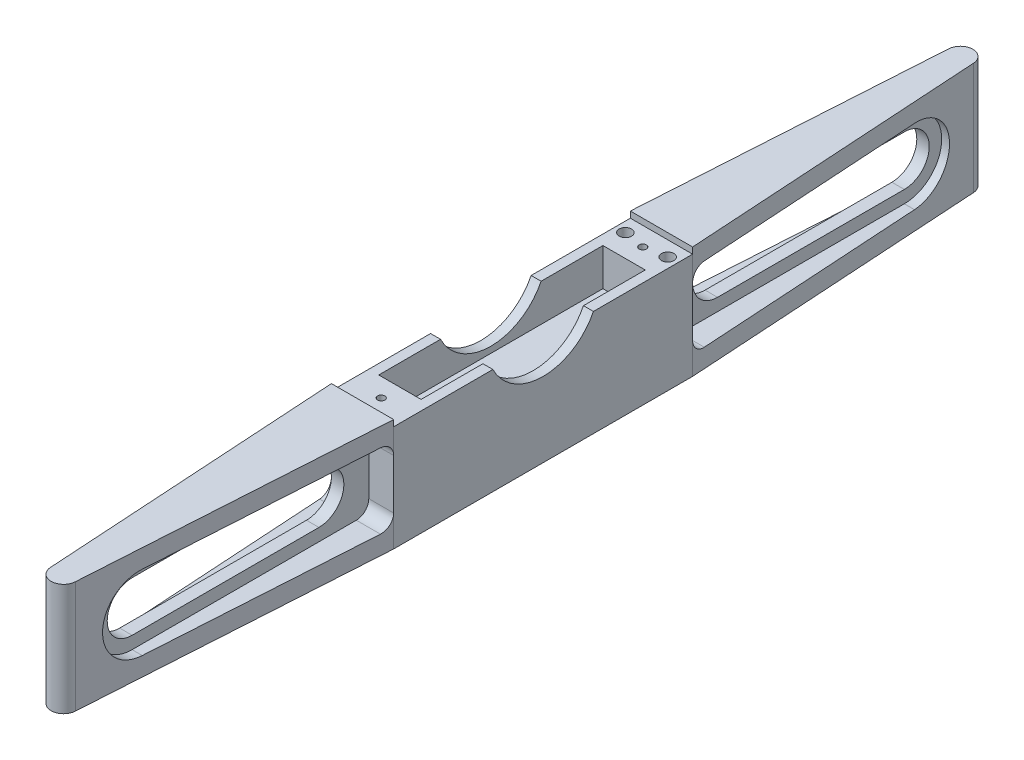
ISO-10303-21;
HEADER;
FILE_DESCRIPTION(('STEP AP214'),'2;1');
FILE_NAME('part.step','',(''),(''),'','','');
FILE_SCHEMA(('AUTOMOTIVE_DESIGN { 1 0 10303 214 1 1 1 1 }'));
ENDSEC;
DATA;
#1=APPLICATION_CONTEXT('core data for automotive mechanical design processes');
#2=APPLICATION_PROTOCOL_DEFINITION('international standard','automotive_design',2000,#1);
#3=PRODUCT_CONTEXT('',#1,'mechanical');
#4=PRODUCT('Part','Part','',(#3));
#5=PRODUCT_RELATED_PRODUCT_CATEGORY('part','',(#4));
#6=PRODUCT_DEFINITION_FORMATION('','',#4);
#7=PRODUCT_DEFINITION_CONTEXT('part definition',#1,'design');
#8=PRODUCT_DEFINITION('design','',#6,#7);
#9=PRODUCT_DEFINITION_SHAPE('','',#8);
#10=(LENGTH_UNIT() NAMED_UNIT(*) SI_UNIT(.MILLI.,.METRE.));
#11=(NAMED_UNIT(*) PLANE_ANGLE_UNIT() SI_UNIT($,.RADIAN.));
#12=(NAMED_UNIT(*) SI_UNIT($,.STERADIAN.) SOLID_ANGLE_UNIT());
#13=UNCERTAINTY_MEASURE_WITH_UNIT(LENGTH_MEASURE(1.E-05),#10,'distance_accuracy_value','');
#14=(GEOMETRIC_REPRESENTATION_CONTEXT(3) GLOBAL_UNCERTAINTY_ASSIGNED_CONTEXT((#13)) GLOBAL_UNIT_ASSIGNED_CONTEXT((#10,
#11,#12)) REPRESENTATION_CONTEXT('',''));
#15=CARTESIAN_POINT('',(0.,0.,0.));
#16=DIRECTION('',(0.,0.,1.));
#17=DIRECTION('',(1.,0.,0.));
#18=AXIS2_PLACEMENT_3D('',#15,#16,#17);
#19=CARTESIAN_POINT('',(-7.93749999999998,26.9875,-38.1));
#20=DIRECTION('',(0.,1.,0.));
#21=DIRECTION('',(0.,0.,1.));
#22=AXIS2_PLACEMENT_3D('',#19,#20,#21);
#23=PLANE('',#22);
#24=DIRECTION('',(1.,0.,0.));
#25=VECTOR('',#24,1.);
#26=CARTESIAN_POINT('',(-7.9375,26.9875,12.8130097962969));
#27=LINE('',#26,#25);
#28=CARTESIAN_POINT('',(-7.9375,26.9875,12.8130097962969));
#29=VERTEX_POINT('',#28);
#30=CARTESIAN_POINT('',(-5.39749999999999,26.9875,12.8130097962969));
#31=VERTEX_POINT('',#30);
#32=EDGE_CURVE('E42',#29,#31,#27,.T.);
#33=ORIENTED_EDGE('',*,*,#32,.F.);
#34=DIRECTION('',(0.,0.,-1.));
#35=VECTOR('',#34,1.);
#36=CARTESIAN_POINT('',(-7.93749999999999,26.9875,38.1));
#37=LINE('',#36,#35);
#38=CARTESIAN_POINT('',(-7.93749999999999,26.9875,38.1));
#39=VERTEX_POINT('',#38);
#40=EDGE_CURVE('E354',#39,#29,#37,.T.);
#41=ORIENTED_EDGE('',*,*,#40,.F.);
#42=DIRECTION('',(1.,0.,0.));
#43=VECTOR('',#42,1.);
#44=CARTESIAN_POINT('',(-7.93749999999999,26.9875,38.1));
#45=LINE('',#44,#43);
#46=CARTESIAN_POINT('',(7.9375,26.9875,38.1));
#47=VERTEX_POINT('',#46);
#48=EDGE_CURVE('E380',#39,#47,#45,.T.);
#49=ORIENTED_EDGE('',*,*,#48,.T.);
#50=DIRECTION('',(0.,0.,1.));
#51=VECTOR('',#50,1.);
#52=CARTESIAN_POINT('',(7.9375,26.9875,-38.1));
#53=LINE('',#52,#51);
#54=CARTESIAN_POINT('',(7.9375,26.9875,12.8130097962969));
#55=VERTEX_POINT('',#54);
#56=EDGE_CURVE('E371',#55,#47,#53,.T.);
#57=ORIENTED_EDGE('',*,*,#56,.F.);
#58=CARTESIAN_POINT('',(5.3975,26.9875,12.8130097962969));
#59=VERTEX_POINT('',#58);
#60=EDGE_CURVE('E361',#59,#55,#27,.T.);
#61=ORIENTED_EDGE('',*,*,#60,.F.);
#62=DIRECTION('',(0.,0.,1.));
#63=VECTOR('',#62,1.);
#64=CARTESIAN_POINT('',(5.39750000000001,26.9875,-28.575));
#65=LINE('',#64,#63);
#66=CARTESIAN_POINT('',(5.3975,26.9875,28.575));
#67=VERTEX_POINT('',#66);
#68=EDGE_CURVE('E809',#59,#67,#65,.T.);
#69=ORIENTED_EDGE('',*,*,#68,.T.);
#70=DIRECTION('',(1.,0.,0.));
#71=VECTOR('',#70,1.);
#72=CARTESIAN_POINT('',(-5.39749999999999,26.9875,28.575));
#73=LINE('',#72,#71);
#74=CARTESIAN_POINT('',(-5.39749999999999,26.9875,28.575));
#75=VERTEX_POINT('',#74);
#76=EDGE_CURVE('E359',#75,#67,#73,.T.);
#77=ORIENTED_EDGE('',*,*,#76,.F.);
#78=DIRECTION('',(0.,0.,-1.));
#79=VECTOR('',#78,1.);
#80=CARTESIAN_POINT('',(-5.39749999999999,26.9875,28.575));
#81=LINE('',#80,#79);
#82=EDGE_CURVE('E358',#75,#31,#81,.T.);
#83=ORIENTED_EDGE('',*,*,#82,.T.);
#84=EDGE_LOOP('',(#33,#41,#49,#57,#61,#69,#77,#83));
#85=FACE_BOUND('',#84,.T.);
#86=CARTESIAN_POINT('',(0.,26.9875,33.3375));
#87=DIRECTION('',(0.,-1.,0.));
#88=DIRECTION('',(0.,0.,-1.));
#89=AXIS2_PLACEMENT_3D('',#86,#87,#88);
#90=CIRCLE('',#89,0.927099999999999);
#91=CARTESIAN_POINT('',(0.,26.9875,32.4104));
#92=VERTEX_POINT('',#91);
#93=EDGE_CURVE('E822',#92,#92,#90,.T.);
#94=ORIENTED_EDGE('',*,*,#93,.T.);
#95=EDGE_LOOP('',(#94));
#96=FACE_BOUND('',#95,.T.);
#97=ADVANCED_FACE('F27',(#85,#96),#23,.T.);
#98=CARTESIAN_POINT('',(7.9375,28.575,-38.1));
#99=DIRECTION('',(1.,0.,0.));
#100=DIRECTION('',(0.,0.,-1.));
#101=AXIS2_PLACEMENT_3D('',#98,#99,#100);
#102=PLANE('',#101);
#103=CARTESIAN_POINT('',(7.9375,33.3375,0.));
#104=DIRECTION('',(1.,0.,0.));
#105=DIRECTION('',(0.,0.,-1.));
#106=AXIS2_PLACEMENT_3D('',#103,#104,#105);
#107=CIRCLE('',#106,14.3002);
#108=CARTESIAN_POINT('',(7.9375,26.9875,-12.8130097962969));
#109=VERTEX_POINT('',#108);
#110=EDGE_CURVE('E348',#55,#109,#107,.T.);
#111=ORIENTED_EDGE('',*,*,#110,.F.);
#112=ORIENTED_EDGE('',*,*,#56,.T.);
#113=DIRECTION('',(0.,-1.,0.));
#114=VECTOR('',#113,1.);
#115=CARTESIAN_POINT('',(7.9375,28.575,38.1));
#116=LINE('',#115,#114);
#117=CARTESIAN_POINT('',(7.9375,20.6375,38.1));
#118=VERTEX_POINT('',#117);
#119=EDGE_CURVE('E575',#47,#118,#116,.T.);
#120=ORIENTED_EDGE('',*,*,#119,.T.);
#121=DIRECTION('',(0.,-1.,0.));
#122=VECTOR('',#121,1.);
#123=CARTESIAN_POINT('',(7.9375,23.8125,38.1));
#124=LINE('',#123,#122);
#125=CARTESIAN_POINT('',(7.9375,7.9375,38.1));
#126=VERTEX_POINT('',#125);
#127=EDGE_CURVE('E491',#118,#126,#124,.T.);
#128=ORIENTED_EDGE('',*,*,#127,.T.);
#129=CARTESIAN_POINT('',(7.9375,0.,38.1));
#130=VERTEX_POINT('',#129);
#131=EDGE_CURVE('E548',#126,#130,#116,.T.);
#132=ORIENTED_EDGE('',*,*,#131,.T.);
#133=DIRECTION('',(0.,0.,1.));
#134=VECTOR('',#133,1.);
#135=CARTESIAN_POINT('',(7.9375,0.,-38.1));
#136=LINE('',#135,#134);
#137=CARTESIAN_POINT('',(7.9375,0.,-38.1));
#138=VERTEX_POINT('',#137);
#139=EDGE_CURVE('E510',#138,#130,#136,.T.);
#140=ORIENTED_EDGE('',*,*,#139,.F.);
#141=DIRECTION('',(0.,-1.,0.));
#142=VECTOR('',#141,1.);
#143=CARTESIAN_POINT('',(7.9375,28.575,-38.1));
#144=LINE('',#143,#142);
#145=CARTESIAN_POINT('',(7.9375,7.9375,-38.1));
#146=VERTEX_POINT('',#145);
#147=EDGE_CURVE('E554',#146,#138,#144,.T.);
#148=ORIENTED_EDGE('',*,*,#147,.F.);
#149=DIRECTION('',(0.,-1.,0.));
#150=VECTOR('',#149,1.);
#151=CARTESIAN_POINT('',(7.9375,23.8125,-38.1));
#152=LINE('',#151,#150);
#153=CARTESIAN_POINT('',(7.9375,20.6375,-38.1));
#154=VERTEX_POINT('',#153);
#155=EDGE_CURVE('E434',#154,#146,#152,.T.);
#156=ORIENTED_EDGE('',*,*,#155,.F.);
#157=CARTESIAN_POINT('',(7.9375,26.9875,-38.1));
#158=VERTEX_POINT('',#157);
#159=EDGE_CURVE('E553',#158,#154,#144,.T.);
#160=ORIENTED_EDGE('',*,*,#159,.F.);
#161=EDGE_CURVE('E377',#158,#109,#53,.T.);
#162=ORIENTED_EDGE('',*,*,#161,.T.);
#163=EDGE_LOOP('',(#111,#112,#120,#128,#132,#140,#148,#156,#160,#162));
#164=FACE_BOUND('',#163,.T.);
#165=ADVANCED_FACE('F29',(#164),#102,.T.);
#166=CARTESIAN_POINT('',(-7.9375,28.575,-38.1));
#167=DIRECTION('',(1.,0.,0.));
#168=DIRECTION('',(0.,0.,-1.));
#169=AXIS2_PLACEMENT_3D('',#166,#167,#168);
#170=PLANE('',#169);
#171=ORIENTED_EDGE('',*,*,#40,.T.);
#172=CARTESIAN_POINT('',(-7.9375,33.3375,0.));
#173=DIRECTION('',(1.,0.,0.));
#174=DIRECTION('',(0.,0.,-1.));
#175=AXIS2_PLACEMENT_3D('',#172,#173,#174);
#176=CIRCLE('',#175,14.3002);
#177=CARTESIAN_POINT('',(-7.9375,26.9875,-12.8130097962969));
#178=VERTEX_POINT('',#177);
#179=EDGE_CURVE('E341',#29,#178,#176,.T.);
#180=ORIENTED_EDGE('',*,*,#179,.T.);
#181=CARTESIAN_POINT('',(-7.93749999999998,26.9875,-38.1));
#182=VERTEX_POINT('',#181);
#183=EDGE_CURVE('E368',#178,#182,#37,.T.);
#184=ORIENTED_EDGE('',*,*,#183,.T.);
#185=DIRECTION('',(0.,-1.,0.));
#186=VECTOR('',#185,1.);
#187=CARTESIAN_POINT('',(-7.9375,28.575,-38.1));
#188=LINE('',#187,#186);
#189=CARTESIAN_POINT('',(-7.9375,20.6375,-38.1));
#190=VERTEX_POINT('',#189);
#191=EDGE_CURVE('E562',#182,#190,#188,.T.);
#192=ORIENTED_EDGE('',*,*,#191,.T.);
#193=DIRECTION('',(0.,-1.,0.));
#194=VECTOR('',#193,1.);
#195=CARTESIAN_POINT('',(-7.9375,23.8125,-38.1));
#196=LINE('',#195,#194);
#197=CARTESIAN_POINT('',(-7.9375,7.9375,-38.1));
#198=VERTEX_POINT('',#197);
#199=EDGE_CURVE('E453',#190,#198,#196,.T.);
#200=ORIENTED_EDGE('',*,*,#199,.T.);
#201=CARTESIAN_POINT('',(-7.9375,0.,-38.1));
#202=VERTEX_POINT('',#201);
#203=EDGE_CURVE('E563',#198,#202,#188,.T.);
#204=ORIENTED_EDGE('',*,*,#203,.T.);
#205=DIRECTION('',(0.,0.,1.));
#206=VECTOR('',#205,1.);
#207=CARTESIAN_POINT('',(-7.9375,0.,-38.1));
#208=LINE('',#207,#206);
#209=CARTESIAN_POINT('',(-7.93749999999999,0.,38.1));
#210=VERTEX_POINT('',#209);
#211=EDGE_CURVE('E521',#202,#210,#208,.T.);
#212=ORIENTED_EDGE('',*,*,#211,.T.);
#213=DIRECTION('',(0.,-1.,0.));
#214=VECTOR('',#213,1.);
#215=CARTESIAN_POINT('',(-7.93749999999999,28.575,38.1));
#216=LINE('',#215,#214);
#217=CARTESIAN_POINT('',(-7.9375,7.9375,38.1));
#218=VERTEX_POINT('',#217);
#219=EDGE_CURVE('E566',#218,#210,#216,.T.);
#220=ORIENTED_EDGE('',*,*,#219,.F.);
#221=DIRECTION('',(0.,-1.,0.));
#222=VECTOR('',#221,1.);
#223=CARTESIAN_POINT('',(-7.9375,23.8125,38.1));
#224=LINE('',#223,#222);
#225=CARTESIAN_POINT('',(-7.93749999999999,20.6375,38.1));
#226=VERTEX_POINT('',#225);
#227=EDGE_CURVE('E472',#226,#218,#224,.T.);
#228=ORIENTED_EDGE('',*,*,#227,.F.);
#229=EDGE_CURVE('E365',#39,#226,#216,.T.);
#230=ORIENTED_EDGE('',*,*,#229,.F.);
#231=EDGE_LOOP('',(#171,#180,#184,#192,#200,#204,#212,#220,#228,#230));
#232=FACE_BOUND('',#231,.T.);
#233=ADVANCED_FACE('F363',(#232),#170,.F.);
#234=CARTESIAN_POINT('',(0.,28.575,114.3));
#235=DIRECTION('',(0.,1.,0.));
#236=DIRECTION('',(0.,0.,1.));
#237=AXIS2_PLACEMENT_3D('',#234,#235,#236);
#238=PLANE('',#237);
#239=DIRECTION('',(-1.,0.,0.));
#240=VECTOR('',#239,1.);
#241=CARTESIAN_POINT('',(7.9375,28.575,-38.1));
#242=LINE('',#241,#240);
#243=CARTESIAN_POINT('',(7.9375,28.575,-38.1));
#244=VERTEX_POINT('',#243);
#245=CARTESIAN_POINT('',(-7.93749999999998,28.575,-38.1));
#246=VERTEX_POINT('',#245);
#247=EDGE_CURVE('E778',#244,#246,#242,.T.);
#248=ORIENTED_EDGE('',*,*,#247,.F.);
#249=DIRECTION('',(-0.0622976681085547,0.,-0.998057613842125));
#250=VECTOR('',#249,1.);
#251=CARTESIAN_POINT('',(7.9375,28.575,-38.1));
#252=LINE('',#251,#250);
#253=CARTESIAN_POINT('',(3.16883292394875,28.575,-114.497795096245));
#254=VERTEX_POINT('',#253);
#255=EDGE_CURVE('E546',#244,#254,#252,.T.);
#256=ORIENTED_EDGE('',*,*,#255,.T.);
#257=CARTESIAN_POINT('',(0.,28.575,-114.3));
#258=DIRECTION('',(0.,-1.,0.));
#259=DIRECTION('',(0.,0.,-1.));
#260=AXIS2_PLACEMENT_3D('',#257,#258,#259);
#261=CIRCLE('',#260,3.17500000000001);
#262=CARTESIAN_POINT('',(-3.16883292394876,28.575,-114.497795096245));
#263=VERTEX_POINT('',#262);
#264=EDGE_CURVE('E543',#263,#254,#261,.T.);
#265=ORIENTED_EDGE('',*,*,#264,.F.);
#266=DIRECTION('',(0.0622976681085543,0.,-0.998057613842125));
#267=VECTOR('',#266,1.);
#268=CARTESIAN_POINT('',(-7.9375,28.575,-38.1));
#269=LINE('',#268,#267);
#270=EDGE_CURVE('E540',#246,#263,#269,.T.);
#271=ORIENTED_EDGE('',*,*,#270,.F.);
#272=EDGE_LOOP('',(#248,#256,#265,#271));
#273=FACE_BOUND('',#272,.T.);
#274=ADVANCED_FACE('F782',(#273),#238,.T.);
#275=CARTESIAN_POINT('',(1.5875,14.2875,98.425));
#276=DIRECTION('',(-1.,0.,0.));
#277=DIRECTION('',(0.,0.,1.));
#278=AXIS2_PLACEMENT_3D('',#275,#276,#277);
#279=PLANE('',#278);
#280=DIRECTION('',(0.,0.,1.));
#281=VECTOR('',#280,1.);
#282=CARTESIAN_POINT('',(1.5875,4.7625,38.1));
#283=LINE('',#282,#281);
#284=CARTESIAN_POINT('',(1.5875,4.7625,41.275));
#285=VERTEX_POINT('',#284);
#286=CARTESIAN_POINT('',(1.5875,4.76250000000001,98.425));
#287=VERTEX_POINT('',#286);
#288=EDGE_CURVE('E497',#285,#287,#283,.T.);
#289=ORIENTED_EDGE('',*,*,#288,.F.);
#290=CARTESIAN_POINT('',(1.5875,7.9375,41.275));
#291=DIRECTION('',(-1.,0.,0.));
#292=DIRECTION('',(0.,0.,1.));
#293=AXIS2_PLACEMENT_3D('',#290,#291,#292);
#294=CIRCLE('',#293,3.175);
#295=CARTESIAN_POINT('',(1.5875,7.9375,38.1));
#296=VERTEX_POINT('',#295);
#297=EDGE_CURVE('E591',#285,#296,#294,.F.);
#298=ORIENTED_EDGE('',*,*,#297,.T.);
#299=DIRECTION('',(0.,-1.,0.));
#300=VECTOR('',#299,1.);
#301=CARTESIAN_POINT('',(1.5875,23.8125,38.1));
#302=LINE('',#301,#300);
#303=CARTESIAN_POINT('',(1.5875,20.6375,38.1));
#304=VERTEX_POINT('',#303);
#305=EDGE_CURVE('E494',#304,#296,#302,.T.);
#306=ORIENTED_EDGE('',*,*,#305,.F.);
#307=CARTESIAN_POINT('',(1.5875,20.6375,41.275));
#308=DIRECTION('',(-1.,0.,0.));
#309=DIRECTION('',(0.,0.,1.));
#310=AXIS2_PLACEMENT_3D('',#307,#308,#309);
#311=CIRCLE('',#310,3.175);
#312=CARTESIAN_POINT('',(1.5875,23.8125,41.275));
#313=VERTEX_POINT('',#312);
#314=EDGE_CURVE('E589',#304,#313,#311,.F.);
#315=ORIENTED_EDGE('',*,*,#314,.T.);
#316=DIRECTION('',(0.,0.,1.));
#317=VECTOR('',#316,1.);
#318=CARTESIAN_POINT('',(1.5875,23.8125,38.1));
#319=LINE('',#318,#317);
#320=CARTESIAN_POINT('',(1.5875,23.8125,98.425));
#321=VERTEX_POINT('',#320);
#322=EDGE_CURVE('E502',#313,#321,#319,.T.);
#323=ORIENTED_EDGE('',*,*,#322,.T.);
#324=CARTESIAN_POINT('',(1.5875,14.2875,98.425));
#325=DIRECTION('',(-1.,0.,0.));
#326=DIRECTION('',(0.,0.,1.));
#327=AXIS2_PLACEMENT_3D('',#324,#325,#326);
#328=CIRCLE('',#327,9.525);
#329=EDGE_CURVE('E499',#287,#321,#328,.T.);
#330=ORIENTED_EDGE('',*,*,#329,.F.);
#331=EDGE_LOOP('',(#289,#298,#306,#315,#323,#330));
#332=FACE_BOUND('',#331,.T.);
#333=CARTESIAN_POINT('',(1.5875,14.2875,50.8));
#334=DIRECTION('',(-1.,0.,0.));
#335=DIRECTION('',(0.,0.,1.));
#336=AXIS2_PLACEMENT_3D('',#333,#334,#335);
#337=CIRCLE('',#336,6.35);
#338=CARTESIAN_POINT('',(1.5875,20.6375,50.8));
#339=VERTEX_POINT('',#338);
#340=CARTESIAN_POINT('',(1.5875,7.9375,50.8));
#341=VERTEX_POINT('',#340);
#342=EDGE_CURVE('E413',#339,#341,#337,.T.);
#343=ORIENTED_EDGE('',*,*,#342,.T.);
#344=DIRECTION('',(0.,0.,1.));
#345=VECTOR('',#344,1.);
#346=CARTESIAN_POINT('',(1.5875,7.9375,50.8));
#347=LINE('',#346,#345);
#348=CARTESIAN_POINT('',(1.5875,7.93750000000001,98.425));
#349=VERTEX_POINT('',#348);
#350=EDGE_CURVE('E416',#341,#349,#347,.T.);
#351=ORIENTED_EDGE('',*,*,#350,.T.);
#352=CARTESIAN_POINT('',(1.5875,14.2875,98.425));
#353=DIRECTION('',(1.,0.,0.));
#354=DIRECTION('',(0.,0.,-1.));
#355=AXIS2_PLACEMENT_3D('',#352,#353,#354);
#356=CIRCLE('',#355,6.35);
#357=CARTESIAN_POINT('',(1.5875,20.6375,98.425));
#358=VERTEX_POINT('',#357);
#359=EDGE_CURVE('E419',#358,#349,#356,.T.);
#360=ORIENTED_EDGE('',*,*,#359,.F.);
#361=DIRECTION('',(0.,0.,1.));
#362=VECTOR('',#361,1.);
#363=CARTESIAN_POINT('',(1.5875,20.6375,50.8));
#364=LINE('',#363,#362);
#365=EDGE_CURVE('E422',#339,#358,#364,.T.);
#366=ORIENTED_EDGE('',*,*,#365,.F.);
#367=EDGE_LOOP('',(#343,#351,#360,#366));
#368=FACE_BOUND('',#367,.T.);
#369=ADVANCED_FACE('F708',(#332,#368),#279,.F.);
#370=CARTESIAN_POINT('',(-1.5875,14.2875,98.425));
#371=DIRECTION('',(1.,0.,0.));
#372=DIRECTION('',(0.,0.,1.));
#373=AXIS2_PLACEMENT_3D('',#370,#371,#372);
#374=PLANE('',#373);
#375=DIRECTION('',(0.,-1.,0.));
#376=VECTOR('',#375,1.);
#377=CARTESIAN_POINT('',(-1.5875,23.8125,38.1));
#378=LINE('',#377,#376);
#379=CARTESIAN_POINT('',(-1.5875,20.6375,38.1));
#380=VERTEX_POINT('',#379);
#381=CARTESIAN_POINT('',(-1.5875,7.9375,38.1));
#382=VERTEX_POINT('',#381);
#383=EDGE_CURVE('E475',#380,#382,#378,.T.);
#384=ORIENTED_EDGE('',*,*,#383,.T.);
#385=CARTESIAN_POINT('',(-1.5875,7.9375,41.275));
#386=DIRECTION('',(1.,0.,0.));
#387=DIRECTION('',(0.,0.,-1.));
#388=AXIS2_PLACEMENT_3D('',#385,#386,#387);
#389=CIRCLE('',#388,3.175);
#390=CARTESIAN_POINT('',(-1.5875,4.7625,41.275));
#391=VERTEX_POINT('',#390);
#392=EDGE_CURVE('E620',#382,#391,#389,.F.);
#393=ORIENTED_EDGE('',*,*,#392,.T.);
#394=DIRECTION('',(0.,0.,1.));
#395=VECTOR('',#394,1.);
#396=CARTESIAN_POINT('',(-1.5875,4.7625,38.1));
#397=LINE('',#396,#395);
#398=CARTESIAN_POINT('',(-1.5875,4.76250000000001,98.425));
#399=VERTEX_POINT('',#398);
#400=EDGE_CURVE('E483',#391,#399,#397,.T.);
#401=ORIENTED_EDGE('',*,*,#400,.T.);
#402=CARTESIAN_POINT('',(-1.5875,14.2875,98.425));
#403=DIRECTION('',(-1.,0.,0.));
#404=DIRECTION('',(0.,0.,1.));
#405=AXIS2_PLACEMENT_3D('',#402,#403,#404);
#406=CIRCLE('',#405,9.525);
#407=CARTESIAN_POINT('',(-1.5875,23.8125,98.425));
#408=VERTEX_POINT('',#407);
#409=EDGE_CURVE('E480',#399,#408,#406,.T.);
#410=ORIENTED_EDGE('',*,*,#409,.T.);
#411=DIRECTION('',(0.,0.,1.));
#412=VECTOR('',#411,1.);
#413=CARTESIAN_POINT('',(-1.5875,23.8125,38.1));
#414=LINE('',#413,#412);
#415=CARTESIAN_POINT('',(-1.5875,23.8125,41.275));
#416=VERTEX_POINT('',#415);
#417=EDGE_CURVE('E478',#416,#408,#414,.T.);
#418=ORIENTED_EDGE('',*,*,#417,.F.);
#419=CARTESIAN_POINT('',(-1.5875,20.6375,41.275));
#420=DIRECTION('',(1.,0.,0.));
#421=DIRECTION('',(0.,0.,-1.));
#422=AXIS2_PLACEMENT_3D('',#419,#420,#421);
#423=CIRCLE('',#422,3.175);
#424=EDGE_CURVE('E618',#416,#380,#423,.F.);
#425=ORIENTED_EDGE('',*,*,#424,.T.);
#426=EDGE_LOOP('',(#384,#393,#401,#410,#418,#425));
#427=FACE_BOUND('',#426,.T.);
#428=CARTESIAN_POINT('',(-1.5875,14.2875,50.8));
#429=DIRECTION('',(1.,0.,0.));
#430=DIRECTION('',(0.,0.,-1.));
#431=AXIS2_PLACEMENT_3D('',#428,#429,#430);
#432=CIRCLE('',#431,6.35);
#433=CARTESIAN_POINT('',(-1.5875,20.6375,50.8));
#434=VERTEX_POINT('',#433);
#435=CARTESIAN_POINT('',(-1.5875,7.9375,50.8));
#436=VERTEX_POINT('',#435);
#437=EDGE_CURVE('E35',#434,#436,#432,.F.);
#438=ORIENTED_EDGE('',*,*,#437,.F.);
#439=DIRECTION('',(0.,0.,1.));
#440=VECTOR('',#439,1.);
#441=CARTESIAN_POINT('',(-1.5875,20.6375,98.425));
#442=LINE('',#441,#440);
#443=CARTESIAN_POINT('',(-1.5875,20.6375,98.425));
#444=VERTEX_POINT('',#443);
#445=EDGE_CURVE('E683',#434,#444,#442,.T.);
#446=ORIENTED_EDGE('',*,*,#445,.T.);
#447=CARTESIAN_POINT('',(-1.5875,14.2875,98.425));
#448=DIRECTION('',(1.,0.,0.));
#449=DIRECTION('',(0.,0.,-1.));
#450=AXIS2_PLACEMENT_3D('',#447,#448,#449);
#451=CIRCLE('',#450,6.35);
#452=CARTESIAN_POINT('',(-1.5875,7.93750000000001,98.425));
#453=VERTEX_POINT('',#452);
#454=EDGE_CURVE('E686',#444,#453,#451,.T.);
#455=ORIENTED_EDGE('',*,*,#454,.T.);
#456=DIRECTION('',(0.,0.,1.));
#457=VECTOR('',#456,1.);
#458=CARTESIAN_POINT('',(-1.5875,7.93750000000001,98.425));
#459=LINE('',#458,#457);
#460=EDGE_CURVE('E689',#436,#453,#459,.T.);
#461=ORIENTED_EDGE('',*,*,#460,.F.);
#462=EDGE_LOOP('',(#438,#446,#455,#461));
#463=FACE_BOUND('',#462,.T.);
#464=ADVANCED_FACE('F701',(#427,#463),#374,.F.);
#465=CARTESIAN_POINT('',(7.9375,28.575,-38.1));
#466=DIRECTION('',(-0.998057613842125,0.,0.0622976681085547));
#467=DIRECTION('',(0.0622976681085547,0.,0.998057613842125));
#468=AXIS2_PLACEMENT_3D('',#465,#466,#467);
#469=PLANE('',#468);
#470=DIRECTION('',(0.0622976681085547,0.,0.998057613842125));
#471=VECTOR('',#470,1.);
#472=CARTESIAN_POINT('',(7.9375,23.8125,-38.1));
#473=LINE('',#472,#471);
#474=CARTESIAN_POINT('',(4.17207927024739,23.8125,-98.425));
#475=VERTEX_POINT('',#474);
#476=CARTESIAN_POINT('',(7.73931996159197,23.8125,-41.275));
#477=VERTEX_POINT('',#476);
#478=EDGE_CURVE('E661',#475,#477,#473,.T.);
#479=ORIENTED_EDGE('',*,*,#478,.F.);
#480=CARTESIAN_POINT('',(4.17207927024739,14.2875,-98.425));
#481=DIRECTION('',(-0.998057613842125,0.,0.0622976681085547));
#482=DIRECTION('',(0.0622976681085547,0.,0.998057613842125));
#483=AXIS2_PLACEMENT_3D('',#480,#481,#482);
#484=ELLIPSE('',#483,9.54353723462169,9.525);
#485=CARTESIAN_POINT('',(4.17207927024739,4.76250000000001,-98.425));
#486=VERTEX_POINT('',#485);
#487=EDGE_CURVE('E658',#475,#486,#484,.T.);
#488=ORIENTED_EDGE('',*,*,#487,.T.);
#489=DIRECTION('',(0.0622976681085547,0.,0.998057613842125));
#490=VECTOR('',#489,1.);
#491=CARTESIAN_POINT('',(7.9375,4.7625,-38.1));
#492=LINE('',#491,#490);
#493=CARTESIAN_POINT('',(7.73931996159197,4.7625,-41.275));
#494=VERTEX_POINT('',#493);
#495=EDGE_CURVE('E655',#486,#494,#492,.T.);
#496=ORIENTED_EDGE('',*,*,#495,.T.);
#497=CARTESIAN_POINT('',(7.73931996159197,7.9375,-41.275));
#498=DIRECTION('',(-0.998057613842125,0.,0.0622976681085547));
#499=DIRECTION('',(-0.0622976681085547,0.,-0.998057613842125));
#500=AXIS2_PLACEMENT_3D('',#497,#498,#499);
#501=ELLIPSE('',#500,3.18117907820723,3.175);
#502=EDGE_CURVE('E678',#494,#146,#501,.T.);
#503=ORIENTED_EDGE('',*,*,#502,.T.);
#504=ORIENTED_EDGE('',*,*,#147,.T.);
#505=DIRECTION('',(-0.0622976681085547,0.,-0.998057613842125));
#506=VECTOR('',#505,1.);
#507=CARTESIAN_POINT('',(7.9375,0.,-38.1));
#508=LINE('',#507,#506);
#509=CARTESIAN_POINT('',(3.16883292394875,0.,-114.497795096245));
#510=VERTEX_POINT('',#509);
#511=EDGE_CURVE('E530',#138,#510,#508,.T.);
#512=ORIENTED_EDGE('',*,*,#511,.T.);
#513=DIRECTION('',(0.,-1.,0.));
#514=VECTOR('',#513,1.);
#515=CARTESIAN_POINT('',(3.16883292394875,28.575,-114.497795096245));
#516=LINE('',#515,#514);
#517=EDGE_CURVE('E555',#254,#510,#516,.T.);
#518=ORIENTED_EDGE('',*,*,#517,.F.);
#519=ORIENTED_EDGE('',*,*,#255,.F.);
#520=EDGE_CURVE('E549',#244,#158,#144,.T.);
#521=ORIENTED_EDGE('',*,*,#520,.T.);
#522=ORIENTED_EDGE('',*,*,#159,.T.);
#523=CARTESIAN_POINT('',(7.73931996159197,20.6375,-41.275));
#524=DIRECTION('',(-0.998057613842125,0.,0.0622976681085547));
#525=DIRECTION('',(0.0622976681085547,0.,0.998057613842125));
#526=AXIS2_PLACEMENT_3D('',#523,#524,#525);
#527=ELLIPSE('',#526,3.18117907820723,3.175);
#528=EDGE_CURVE('E681',#154,#477,#527,.T.);
#529=ORIENTED_EDGE('',*,*,#528,.T.);
#530=EDGE_LOOP('',(#479,#488,#496,#503,#504,#512,#518,#519,#521,#522,#529));
#531=FACE_BOUND('',#530,.T.);
#532=ADVANCED_FACE('F774',(#531),#469,.F.);
#533=CARTESIAN_POINT('',(-7.9375,28.575,-38.1));
#534=DIRECTION('',(-0.998057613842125,0.,-0.0622976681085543));
#535=DIRECTION('',(-0.0622976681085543,0.,0.998057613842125));
#536=AXIS2_PLACEMENT_3D('',#533,#534,#535);
#537=PLANE('',#536);
#538=ORIENTED_EDGE('',*,*,#203,.F.);
#539=CARTESIAN_POINT('',(-7.73931996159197,7.9375,-41.275));
#540=DIRECTION('',(-0.998057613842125,0.,-0.0622976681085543));
#541=DIRECTION('',(0.0622976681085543,0.,-0.998057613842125));
#542=AXIS2_PLACEMENT_3D('',#539,#540,#541);
#543=ELLIPSE('',#542,3.18117907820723,3.175);
#544=CARTESIAN_POINT('',(-7.73931996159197,4.7625,-41.275));
#545=VERTEX_POINT('',#544);
#546=EDGE_CURVE('E650',#198,#545,#543,.F.);
#547=ORIENTED_EDGE('',*,*,#546,.T.);
#548=DIRECTION('',(0.0622976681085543,0.,-0.998057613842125));
#549=VECTOR('',#548,1.);
#550=CARTESIAN_POINT('',(-7.9375,4.7625,-38.1));
#551=LINE('',#550,#549);
#552=CARTESIAN_POINT('',(-4.17207927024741,4.76250000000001,-98.425));
#553=VERTEX_POINT('',#552);
#554=EDGE_CURVE('E634',#545,#553,#551,.T.);
#555=ORIENTED_EDGE('',*,*,#554,.T.);
#556=CARTESIAN_POINT('',(-4.17207927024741,14.2875,-98.425));
#557=DIRECTION('',(-0.998057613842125,0.,-0.0622976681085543));
#558=DIRECTION('',(-0.0622976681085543,0.,0.998057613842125));
#559=AXIS2_PLACEMENT_3D('',#556,#557,#558);
#560=ELLIPSE('',#559,9.54353723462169,9.525);
#561=CARTESIAN_POINT('',(-4.17207927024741,23.8125,-98.425));
#562=VERTEX_POINT('',#561);
#563=EDGE_CURVE('E631',#553,#562,#560,.F.);
#564=ORIENTED_EDGE('',*,*,#563,.T.);
#565=DIRECTION('',(0.0622976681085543,0.,-0.998057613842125));
#566=VECTOR('',#565,1.);
#567=CARTESIAN_POINT('',(-7.9375,23.8125,-38.1));
#568=LINE('',#567,#566);
#569=CARTESIAN_POINT('',(-7.73931996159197,23.8125,-41.275));
#570=VERTEX_POINT('',#569);
#571=EDGE_CURVE('E629',#570,#562,#568,.T.);
#572=ORIENTED_EDGE('',*,*,#571,.F.);
#573=CARTESIAN_POINT('',(-7.73931996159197,20.6375,-41.275));
#574=DIRECTION('',(-0.998057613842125,0.,-0.0622976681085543));
#575=DIRECTION('',(-0.0622976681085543,0.,0.998057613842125));
#576=AXIS2_PLACEMENT_3D('',#573,#574,#575);
#577=ELLIPSE('',#576,3.18117907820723,3.175);
#578=EDGE_CURVE('E652',#570,#190,#577,.F.);
#579=ORIENTED_EDGE('',*,*,#578,.T.);
#580=ORIENTED_EDGE('',*,*,#191,.F.);
#581=EDGE_CURVE('E559',#246,#182,#188,.T.);
#582=ORIENTED_EDGE('',*,*,#581,.F.);
#583=ORIENTED_EDGE('',*,*,#270,.T.);
#584=DIRECTION('',(0.,-1.,0.));
#585=VECTOR('',#584,1.);
#586=CARTESIAN_POINT('',(-3.16883292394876,28.575,-114.497795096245));
#587=LINE('',#586,#585);
#588=CARTESIAN_POINT('',(-3.16883292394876,0.,-114.497795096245));
#589=VERTEX_POINT('',#588);
#590=EDGE_CURVE('E557',#263,#589,#587,.T.);
#591=ORIENTED_EDGE('',*,*,#590,.T.);
#592=DIRECTION('',(0.0622976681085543,0.,-0.998057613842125));
#593=VECTOR('',#592,1.);
#594=CARTESIAN_POINT('',(-7.9375,0.,-38.1));
#595=LINE('',#594,#593);
#596=EDGE_CURVE('E524',#202,#589,#595,.T.);
#597=ORIENTED_EDGE('',*,*,#596,.F.);
#598=EDGE_LOOP('',(#538,#547,#555,#564,#572,#579,#580,#582,#583,#591,#597));
#599=FACE_BOUND('',#598,.T.);
#600=ADVANCED_FACE('F957',(#599),#537,.T.);
#601=CARTESIAN_POINT('',(-7.93749999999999,28.575,38.1));
#602=DIRECTION('',(0.998057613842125,0.,-0.062297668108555));
#603=DIRECTION('',(-0.062297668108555,0.,-0.998057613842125));
#604=AXIS2_PLACEMENT_3D('',#601,#602,#603);
#605=PLANE('',#604);
#606=DIRECTION('',(-0.062297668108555,0.,-0.998057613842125));
#607=VECTOR('',#606,1.);
#608=CARTESIAN_POINT('',(-7.93749999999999,23.8125,38.1));
#609=LINE('',#608,#607);
#610=CARTESIAN_POINT('',(-4.17207927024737,23.8125,98.425));
#611=VERTEX_POINT('',#610);
#612=CARTESIAN_POINT('',(-7.73931996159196,23.8125,41.275));
#613=VERTEX_POINT('',#612);
#614=EDGE_CURVE('E607',#611,#613,#609,.T.);
#615=ORIENTED_EDGE('',*,*,#614,.F.);
#616=CARTESIAN_POINT('',(-4.17207927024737,14.2875,98.425));
#617=DIRECTION('',(0.998057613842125,0.,-0.062297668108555));
#618=DIRECTION('',(-0.062297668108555,0.,-0.998057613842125));
#619=AXIS2_PLACEMENT_3D('',#616,#617,#618);
#620=ELLIPSE('',#619,9.54353723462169,9.525);
#621=CARTESIAN_POINT('',(-4.17207927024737,4.76250000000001,98.425));
#622=VERTEX_POINT('',#621);
#623=EDGE_CURVE('E604',#611,#622,#620,.T.);
#624=ORIENTED_EDGE('',*,*,#623,.T.);
#625=DIRECTION('',(-0.062297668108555,0.,-0.998057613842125));
#626=VECTOR('',#625,1.);
#627=CARTESIAN_POINT('',(-7.93749999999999,4.7625,38.1));
#628=LINE('',#627,#626);
#629=CARTESIAN_POINT('',(-7.73931996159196,4.7625,41.275));
#630=VERTEX_POINT('',#629);
#631=EDGE_CURVE('E601',#622,#630,#628,.T.);
#632=ORIENTED_EDGE('',*,*,#631,.T.);
#633=CARTESIAN_POINT('',(-7.73931996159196,7.9375,41.275));
#634=DIRECTION('',(0.998057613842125,0.,-0.062297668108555));
#635=DIRECTION('',(0.062297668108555,0.,0.998057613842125));
#636=AXIS2_PLACEMENT_3D('',#633,#634,#635);
#637=ELLIPSE('',#636,3.18117907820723,3.175);
#638=EDGE_CURVE('E624',#630,#218,#637,.T.);
#639=ORIENTED_EDGE('',*,*,#638,.T.);
#640=ORIENTED_EDGE('',*,*,#219,.T.);
#641=DIRECTION('',(0.062297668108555,0.,0.998057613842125));
#642=VECTOR('',#641,1.);
#643=CARTESIAN_POINT('',(-7.93749999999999,0.,38.1));
#644=LINE('',#643,#642);
#645=CARTESIAN_POINT('',(-3.16883292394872,0.,114.497795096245));
#646=VERTEX_POINT('',#645);
#647=EDGE_CURVE('E519',#210,#646,#644,.T.);
#648=ORIENTED_EDGE('',*,*,#647,.T.);
#649=DIRECTION('',(0.,-1.,0.));
#650=VECTOR('',#649,1.);
#651=CARTESIAN_POINT('',(-3.16883292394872,28.575,114.497795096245));
#652=LINE('',#651,#650);
#653=CARTESIAN_POINT('',(-3.16883292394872,28.575,114.497795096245));
#654=VERTEX_POINT('',#653);
#655=EDGE_CURVE('E567',#654,#646,#652,.T.);
#656=ORIENTED_EDGE('',*,*,#655,.F.);
#657=DIRECTION('',(0.062297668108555,0.,0.998057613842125));
#658=VECTOR('',#657,1.);
#659=CARTESIAN_POINT('',(-7.93749999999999,28.575,38.1));
#660=LINE('',#659,#658);
#661=CARTESIAN_POINT('',(-7.93749999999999,28.575,38.1));
#662=VERTEX_POINT('',#661);
#663=EDGE_CURVE('E538',#662,#654,#660,.T.);
#664=ORIENTED_EDGE('',*,*,#663,.F.);
#665=EDGE_CURVE('E564',#662,#39,#216,.T.);
#666=ORIENTED_EDGE('',*,*,#665,.T.);
#667=ORIENTED_EDGE('',*,*,#229,.T.);
#668=CARTESIAN_POINT('',(-7.73931996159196,20.6375,41.275));
#669=DIRECTION('',(0.998057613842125,0.,-0.062297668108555));
#670=DIRECTION('',(-0.062297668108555,0.,-0.998057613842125));
#671=AXIS2_PLACEMENT_3D('',#668,#669,#670);
#672=ELLIPSE('',#671,3.18117907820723,3.175);
#673=EDGE_CURVE('E627',#226,#613,#672,.T.);
#674=ORIENTED_EDGE('',*,*,#673,.T.);
#675=EDGE_LOOP('',(#615,#624,#632,#639,#640,#648,#656,#664,#666,#667,#674));
#676=FACE_BOUND('',#675,.T.);
#677=ADVANCED_FACE('F964',(#676),#605,.F.);
#678=CARTESIAN_POINT('',(7.9375,28.575,38.1));
#679=DIRECTION('',(0.998057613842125,0.,0.0622976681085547));
#680=DIRECTION('',(0.0622976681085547,0.,-0.998057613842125));
#681=AXIS2_PLACEMENT_3D('',#678,#679,#680);
#682=PLANE('',#681);
#683=ORIENTED_EDGE('',*,*,#131,.F.);
#684=CARTESIAN_POINT('',(7.73931996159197,7.9375,41.275));
#685=DIRECTION('',(0.998057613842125,0.,0.0622976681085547));
#686=DIRECTION('',(-0.0622976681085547,0.,0.998057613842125));
#687=AXIS2_PLACEMENT_3D('',#684,#685,#686);
#688=ELLIPSE('',#687,3.18117907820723,3.175);
#689=CARTESIAN_POINT('',(7.73931996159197,4.7625,41.275));
#690=VERTEX_POINT('',#689);
#691=EDGE_CURVE('E596',#126,#690,#688,.F.);
#692=ORIENTED_EDGE('',*,*,#691,.T.);
#693=DIRECTION('',(-0.0622976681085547,0.,0.998057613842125));
#694=VECTOR('',#693,1.);
#695=CARTESIAN_POINT('',(7.9375,4.7625,38.1));
#696=LINE('',#695,#694);
#697=CARTESIAN_POINT('',(4.17207927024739,4.76250000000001,98.425));
#698=VERTEX_POINT('',#697);
#699=EDGE_CURVE('E580',#690,#698,#696,.T.);
#700=ORIENTED_EDGE('',*,*,#699,.T.);
#701=CARTESIAN_POINT('',(4.17207927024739,14.2875,98.425));
#702=DIRECTION('',(0.998057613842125,0.,0.0622976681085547));
#703=DIRECTION('',(0.0622976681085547,0.,-0.998057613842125));
#704=AXIS2_PLACEMENT_3D('',#701,#702,#703);
#705=ELLIPSE('',#704,9.54353723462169,9.525);
#706=CARTESIAN_POINT('',(4.17207927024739,23.8125,98.425));
#707=VERTEX_POINT('',#706);
#708=EDGE_CURVE('E577',#698,#707,#705,.F.);
#709=ORIENTED_EDGE('',*,*,#708,.T.);
#710=DIRECTION('',(-0.0622976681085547,0.,0.998057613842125));
#711=VECTOR('',#710,1.);
#712=CARTESIAN_POINT('',(7.9375,23.8125,38.1));
#713=LINE('',#712,#711);
#714=CARTESIAN_POINT('',(7.73931996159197,23.8125,41.275));
#715=VERTEX_POINT('',#714);
#716=EDGE_CURVE('E552',#715,#707,#713,.T.);
#717=ORIENTED_EDGE('',*,*,#716,.F.);
#718=CARTESIAN_POINT('',(7.73931996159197,20.6375,41.275));
#719=DIRECTION('',(0.998057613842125,0.,0.0622976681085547));
#720=DIRECTION('',(0.0622976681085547,0.,-0.998057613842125));
#721=AXIS2_PLACEMENT_3D('',#718,#719,#720);
#722=ELLIPSE('',#721,3.18117907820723,3.175);
#723=EDGE_CURVE('E598',#715,#118,#722,.F.);
#724=ORIENTED_EDGE('',*,*,#723,.T.);
#725=ORIENTED_EDGE('',*,*,#119,.F.);
#726=CARTESIAN_POINT('',(7.9375,28.575,38.1));
#727=VERTEX_POINT('',#726);
#728=EDGE_CURVE('E572',#727,#47,#116,.T.);
#729=ORIENTED_EDGE('',*,*,#728,.F.);
#730=DIRECTION('',(-0.0622976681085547,0.,0.998057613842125));
#731=VECTOR('',#730,1.);
#732=CARTESIAN_POINT('',(7.9375,28.575,38.1));
#733=LINE('',#732,#731);
#734=CARTESIAN_POINT('',(3.16883292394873,28.575,114.497795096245));
#735=VERTEX_POINT('',#734);
#736=EDGE_CURVE('E533',#727,#735,#733,.T.);
#737=ORIENTED_EDGE('',*,*,#736,.T.);
#738=DIRECTION('',(0.,-1.,0.));
#739=VECTOR('',#738,1.);
#740=CARTESIAN_POINT('',(3.16883292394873,28.575,114.497795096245));
#741=LINE('',#740,#739);
#742=CARTESIAN_POINT('',(3.16883292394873,0.,114.497795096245));
#743=VERTEX_POINT('',#742);
#744=EDGE_CURVE('E570',#735,#743,#741,.T.);
#745=ORIENTED_EDGE('',*,*,#744,.T.);
#746=DIRECTION('',(-0.0622976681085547,0.,0.998057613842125));
#747=VECTOR('',#746,1.);
#748=CARTESIAN_POINT('',(7.9375,0.,38.1));
#749=LINE('',#748,#747);
#750=EDGE_CURVE('E513',#130,#743,#749,.T.);
#751=ORIENTED_EDGE('',*,*,#750,.F.);
#752=EDGE_LOOP('',(#683,#692,#700,#709,#717,#724,#725,#729,#737,#745,#751));
#753=FACE_BOUND('',#752,.T.);
#754=ADVANCED_FACE('F890',(#753),#682,.T.);
#755=CARTESIAN_POINT('',(0.,28.575,-114.3));
#756=DIRECTION('',(0.,-1.,0.));
#757=DIRECTION('',(0.,0.,-1.));
#758=AXIS2_PLACEMENT_3D('',#755,#756,#757);
#759=CYLINDRICAL_SURFACE('',#758,3.17500000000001);
#760=CARTESIAN_POINT('',(0.,0.,-114.3));
#761=DIRECTION('',(0.,-1.,0.));
#762=DIRECTION('',(0.,0.,-1.));
#763=AXIS2_PLACEMENT_3D('',#760,#761,#762);
#764=CIRCLE('',#763,3.17500000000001);
#765=EDGE_CURVE('E527',#589,#510,#764,.T.);
#766=ORIENTED_EDGE('',*,*,#765,.F.);
#767=ORIENTED_EDGE('',*,*,#590,.F.);
#768=ORIENTED_EDGE('',*,*,#264,.T.);
#769=ORIENTED_EDGE('',*,*,#517,.T.);
#770=EDGE_LOOP('',(#766,#767,#768,#769));
#771=FACE_BOUND('',#770,.T.);
#772=ADVANCED_FACE('F958',(#771),#759,.T.);
#773=CARTESIAN_POINT('',(0.,28.575,114.3));
#774=DIRECTION('',(0.,-1.,0.));
#775=DIRECTION('',(0.,0.,-1.));
#776=AXIS2_PLACEMENT_3D('',#773,#774,#775);
#777=CYLINDRICAL_SURFACE('',#776,3.17499999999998);
#778=CARTESIAN_POINT('',(0.,0.,114.3));
#779=DIRECTION('',(0.,1.,0.));
#780=DIRECTION('',(0.,0.,1.));
#781=AXIS2_PLACEMENT_3D('',#778,#779,#780);
#782=CIRCLE('',#781,3.17499999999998);
#783=EDGE_CURVE('E516',#646,#743,#782,.T.);
#784=ORIENTED_EDGE('',*,*,#783,.T.);
#785=ORIENTED_EDGE('',*,*,#744,.F.);
#786=CARTESIAN_POINT('',(0.,28.575,114.3));
#787=DIRECTION('',(0.,1.,0.));
#788=DIRECTION('',(0.,0.,1.));
#789=AXIS2_PLACEMENT_3D('',#786,#787,#788);
#790=CIRCLE('',#789,3.17499999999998);
#791=EDGE_CURVE('E536',#654,#735,#790,.T.);
#792=ORIENTED_EDGE('',*,*,#791,.F.);
#793=ORIENTED_EDGE('',*,*,#655,.T.);
#794=EDGE_LOOP('',(#784,#785,#792,#793));
#795=FACE_BOUND('',#794,.T.);
#796=ADVANCED_FACE('F898',(#795),#777,.T.);
#797=DIRECTION('',(1.,0.,0.));
#798=VECTOR('',#797,1.);
#799=CARTESIAN_POINT('',(-7.93749999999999,28.575,38.1));
#800=LINE('',#799,#798);
#801=EDGE_CURVE('E373',#662,#727,#800,.T.);
#802=ORIENTED_EDGE('',*,*,#801,.F.);
#803=ORIENTED_EDGE('',*,*,#663,.T.);
#804=ORIENTED_EDGE('',*,*,#791,.T.);
#805=ORIENTED_EDGE('',*,*,#736,.F.);
#806=EDGE_LOOP('',(#802,#803,#804,#805));
#807=FACE_BOUND('',#806,.T.);
#808=ADVANCED_FACE('F892',(#807),#238,.T.);
#809=CARTESIAN_POINT('',(0.,0.,114.3));
#810=DIRECTION('',(0.,1.,0.));
#811=DIRECTION('',(0.,0.,1.));
#812=AXIS2_PLACEMENT_3D('',#809,#810,#811);
#813=PLANE('',#812);
#814=CARTESIAN_POINT('',(5.3975,0.,-34.29));
#815=DIRECTION('',(0.,1.,0.));
#816=DIRECTION('',(0.,0.,1.));
#817=AXIS2_PLACEMENT_3D('',#814,#815,#816);
#818=CIRCLE('',#817,1.58749999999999);
#819=CARTESIAN_POINT('',(5.3975,0.,-32.7025));
#820=VERTEX_POINT('',#819);
#821=EDGE_CURVE('E830',#820,#820,#818,.T.);
#822=ORIENTED_EDGE('',*,*,#821,.T.);
#823=EDGE_LOOP('',(#822));
#824=FACE_BOUND('',#823,.T.);
#825=CARTESIAN_POINT('',(-5.39749999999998,0.,-34.29));
#826=DIRECTION('',(0.,1.,0.));
#827=DIRECTION('',(0.,0.,1.));
#828=AXIS2_PLACEMENT_3D('',#825,#826,#827);
#829=CIRCLE('',#828,1.58749999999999);
#830=CARTESIAN_POINT('',(-5.39749999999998,0.,-32.7025));
#831=VERTEX_POINT('',#830);
#832=EDGE_CURVE('E826',#831,#831,#829,.T.);
#833=ORIENTED_EDGE('',*,*,#832,.T.);
#834=EDGE_LOOP('',(#833));
#835=FACE_BOUND('',#834,.T.);
#836=ORIENTED_EDGE('',*,*,#139,.T.);
#837=ORIENTED_EDGE('',*,*,#750,.T.);
#838=ORIENTED_EDGE('',*,*,#783,.F.);
#839=ORIENTED_EDGE('',*,*,#647,.F.);
#840=ORIENTED_EDGE('',*,*,#211,.F.);
#841=ORIENTED_EDGE('',*,*,#596,.T.);
#842=ORIENTED_EDGE('',*,*,#765,.T.);
#843=ORIENTED_EDGE('',*,*,#511,.F.);
#844=EDGE_LOOP('',(#836,#837,#838,#839,#840,#841,#842,#843));
#845=FACE_BOUND('',#844,.T.);
#846=ADVANCED_FACE('F834',(#824,#835,#845),#813,.F.);
#847=CARTESIAN_POINT('',(1.5875,23.8125,38.1));
#848=DIRECTION('',(0.,0.,1.));
#849=DIRECTION('',(1.,0.,0.));
#850=AXIS2_PLACEMENT_3D('',#847,#848,#849);
#851=PLANE('',#850);
#852=ORIENTED_EDGE('',*,*,#305,.T.);
#853=DIRECTION('',(1.,0.,0.));
#854=VECTOR('',#853,1.);
#855=CARTESIAN_POINT('',(7.9375,7.9375,38.1));
#856=LINE('',#855,#854);
#857=EDGE_CURVE('E584',#296,#126,#856,.T.);
#858=ORIENTED_EDGE('',*,*,#857,.T.);
#859=ORIENTED_EDGE('',*,*,#127,.F.);
#860=DIRECTION('',(1.,0.,0.));
#861=VECTOR('',#860,1.);
#862=CARTESIAN_POINT('',(1.5875,20.6375,38.1));
#863=LINE('',#862,#861);
#864=EDGE_CURVE('E582',#118,#304,#863,.F.);
#865=ORIENTED_EDGE('',*,*,#864,.T.);
#866=EDGE_LOOP('',(#852,#858,#859,#865));
#867=FACE_BOUND('',#866,.T.);
#868=ADVANCED_FACE('F906',(#867),#851,.T.);
#869=CARTESIAN_POINT('',(1.5875,4.7625,38.1));
#870=DIRECTION('',(0.,1.,0.));
#871=DIRECTION('',(0.,0.,1.));
#872=AXIS2_PLACEMENT_3D('',#869,#870,#871);
#873=PLANE('',#872);
#874=ORIENTED_EDGE('',*,*,#699,.F.);
#875=DIRECTION('',(1.,0.,0.));
#876=VECTOR('',#875,1.);
#877=CARTESIAN_POINT('',(1.5875,4.7625,41.275));
#878=LINE('',#877,#876);
#879=EDGE_CURVE('E587',#690,#285,#878,.F.);
#880=ORIENTED_EDGE('',*,*,#879,.T.);
#881=ORIENTED_EDGE('',*,*,#288,.T.);
#882=DIRECTION('',(1.,0.,0.));
#883=VECTOR('',#882,1.);
#884=CARTESIAN_POINT('',(1.5875,4.76250000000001,98.425));
#885=LINE('',#884,#883);
#886=EDGE_CURVE('E507',#287,#698,#885,.T.);
#887=ORIENTED_EDGE('',*,*,#886,.T.);
#888=EDGE_LOOP('',(#874,#880,#881,#887));
#889=FACE_BOUND('',#888,.T.);
#890=ADVANCED_FACE('F929',(#889),#873,.T.);
#891=CARTESIAN_POINT('',(1.5875,14.2875,98.425));
#892=DIRECTION('',(1.,0.,0.));
#893=DIRECTION('',(0.,0.,-1.));
#894=AXIS2_PLACEMENT_3D('',#891,#892,#893);
#895=CYLINDRICAL_SURFACE('',#894,9.525);
#896=ORIENTED_EDGE('',*,*,#886,.F.);
#897=ORIENTED_EDGE('',*,*,#329,.T.);
#898=DIRECTION('',(1.,0.,0.));
#899=VECTOR('',#898,1.);
#900=CARTESIAN_POINT('',(1.5875,23.8125,98.425));
#901=LINE('',#900,#899);
#902=EDGE_CURVE('E504',#321,#707,#901,.T.);
#903=ORIENTED_EDGE('',*,*,#902,.T.);
#904=ORIENTED_EDGE('',*,*,#708,.F.);
#905=EDGE_LOOP('',(#896,#897,#903,#904));
#906=FACE_BOUND('',#905,.T.);
#907=ADVANCED_FACE('F925',(#906),#895,.F.);
#908=CARTESIAN_POINT('',(1.5875,23.8125,38.1));
#909=DIRECTION('',(0.,1.,0.));
#910=DIRECTION('',(0.,0.,1.));
#911=AXIS2_PLACEMENT_3D('',#908,#909,#910);
#912=PLANE('',#911);
#913=ORIENTED_EDGE('',*,*,#322,.F.);
#914=DIRECTION('',(1.,0.,0.));
#915=VECTOR('',#914,1.);
#916=CARTESIAN_POINT('',(1.5875,23.8125,41.275));
#917=LINE('',#916,#915);
#918=EDGE_CURVE('E593',#313,#715,#917,.T.);
#919=ORIENTED_EDGE('',*,*,#918,.T.);
#920=ORIENTED_EDGE('',*,*,#716,.T.);
#921=ORIENTED_EDGE('',*,*,#902,.F.);
#922=EDGE_LOOP('',(#913,#919,#920,#921));
#923=FACE_BOUND('',#922,.T.);
#924=ADVANCED_FACE('F921',(#923),#912,.F.);
#925=CARTESIAN_POINT('',(1.5875,7.9375,41.275));
#926=DIRECTION('',(-1.,0.,0.));
#927=DIRECTION('',(0.,0.,1.));
#928=AXIS2_PLACEMENT_3D('',#925,#926,#927);
#929=CYLINDRICAL_SURFACE('',#928,3.175);
#930=ORIENTED_EDGE('',*,*,#297,.F.);
#931=ORIENTED_EDGE('',*,*,#879,.F.);
#932=ORIENTED_EDGE('',*,*,#691,.F.);
#933=ORIENTED_EDGE('',*,*,#857,.F.);
#934=EDGE_LOOP('',(#930,#931,#932,#933));
#935=FACE_BOUND('',#934,.T.);
#936=ADVANCED_FACE('F932',(#935),#929,.F.);
#937=CARTESIAN_POINT('',(1.5875,20.6375,41.275));
#938=DIRECTION('',(1.,0.,0.));
#939=DIRECTION('',(0.,0.,-1.));
#940=AXIS2_PLACEMENT_3D('',#937,#938,#939);
#941=CYLINDRICAL_SURFACE('',#940,3.175);
#942=ORIENTED_EDGE('',*,*,#314,.F.);
#943=ORIENTED_EDGE('',*,*,#864,.F.);
#944=ORIENTED_EDGE('',*,*,#723,.F.);
#945=ORIENTED_EDGE('',*,*,#918,.F.);
#946=EDGE_LOOP('',(#942,#943,#944,#945));
#947=FACE_BOUND('',#946,.T.);
#948=ADVANCED_FACE('F914',(#947),#941,.F.);
#949=CARTESIAN_POINT('',(-1.5875,23.8125,38.1));
#950=DIRECTION('',(0.,-1.,0.));
#951=DIRECTION('',(0.,0.,-1.));
#952=AXIS2_PLACEMENT_3D('',#949,#950,#951);
#953=PLANE('',#952);
#954=ORIENTED_EDGE('',*,*,#614,.T.);
#955=DIRECTION('',(-1.,0.,0.));
#956=VECTOR('',#955,1.);
#957=CARTESIAN_POINT('',(-1.5875,23.8125,41.275));
#958=LINE('',#957,#956);
#959=EDGE_CURVE('E622',#613,#416,#958,.F.);
#960=ORIENTED_EDGE('',*,*,#959,.T.);
#961=ORIENTED_EDGE('',*,*,#417,.T.);
#962=DIRECTION('',(-1.,0.,0.));
#963=VECTOR('',#962,1.);
#964=CARTESIAN_POINT('',(-1.5875,23.8125,98.425));
#965=LINE('',#964,#963);
#966=EDGE_CURVE('E488',#408,#611,#965,.T.);
#967=ORIENTED_EDGE('',*,*,#966,.T.);
#968=EDGE_LOOP('',(#954,#960,#961,#967));
#969=FACE_BOUND('',#968,.T.);
#970=ADVANCED_FACE('F939',(#969),#953,.T.);
#971=CARTESIAN_POINT('',(-1.5875,14.2875,98.425));
#972=DIRECTION('',(-1.,0.,0.));
#973=DIRECTION('',(0.,0.,1.));
#974=AXIS2_PLACEMENT_3D('',#971,#972,#973);
#975=CYLINDRICAL_SURFACE('',#974,9.525);
#976=ORIENTED_EDGE('',*,*,#966,.F.);
#977=ORIENTED_EDGE('',*,*,#409,.F.);
#978=DIRECTION('',(-1.,0.,0.));
#979=VECTOR('',#978,1.);
#980=CARTESIAN_POINT('',(-1.5875,4.76250000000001,98.425));
#981=LINE('',#980,#979);
#982=EDGE_CURVE('E485',#399,#622,#981,.T.);
#983=ORIENTED_EDGE('',*,*,#982,.T.);
#984=ORIENTED_EDGE('',*,*,#623,.F.);
#985=EDGE_LOOP('',(#976,#977,#983,#984));
#986=FACE_BOUND('',#985,.T.);
#987=ADVANCED_FACE('F1230',(#986),#975,.F.);
#988=CARTESIAN_POINT('',(-1.5875,4.7625,38.1));
#989=DIRECTION('',(0.,-1.,0.));
#990=DIRECTION('',(0.,0.,-1.));
#991=AXIS2_PLACEMENT_3D('',#988,#989,#990);
#992=PLANE('',#991);
#993=ORIENTED_EDGE('',*,*,#400,.F.);
#994=DIRECTION('',(-1.,0.,0.));
#995=VECTOR('',#994,1.);
#996=CARTESIAN_POINT('',(-7.9375,4.7625,41.275));
#997=LINE('',#996,#995);
#998=EDGE_CURVE('E610',#391,#630,#997,.T.);
#999=ORIENTED_EDGE('',*,*,#998,.T.);
#1000=ORIENTED_EDGE('',*,*,#631,.F.);
#1001=ORIENTED_EDGE('',*,*,#982,.F.);
#1002=EDGE_LOOP('',(#993,#999,#1000,#1001));
#1003=FACE_BOUND('',#1002,.T.);
#1004=ADVANCED_FACE('F1223',(#1003),#992,.F.);
#1005=CARTESIAN_POINT('',(-1.5875,23.8125,38.1));
#1006=DIRECTION('',(0.,0.,-1.));
#1007=DIRECTION('',(-1.,0.,0.));
#1008=AXIS2_PLACEMENT_3D('',#1005,#1006,#1007);
#1009=PLANE('',#1008);
#1010=ORIENTED_EDGE('',*,*,#227,.T.);
#1011=DIRECTION('',(-1.,0.,0.));
#1012=VECTOR('',#1011,1.);
#1013=CARTESIAN_POINT('',(-1.5875,7.9375,38.1));
#1014=LINE('',#1013,#1012);
#1015=EDGE_CURVE('E616',#218,#382,#1014,.F.);
#1016=ORIENTED_EDGE('',*,*,#1015,.T.);
#1017=ORIENTED_EDGE('',*,*,#383,.F.);
#1018=DIRECTION('',(-1.,0.,0.));
#1019=VECTOR('',#1018,1.);
#1020=CARTESIAN_POINT('',(-1.5875,20.6375,38.1));
#1021=LINE('',#1020,#1019);
#1022=EDGE_CURVE('E613',#380,#226,#1021,.T.);
#1023=ORIENTED_EDGE('',*,*,#1022,.T.);
#1024=EDGE_LOOP('',(#1010,#1016,#1017,#1023));
#1025=FACE_BOUND('',#1024,.T.);
#1026=ADVANCED_FACE('F1215',(#1025),#1009,.F.);
#1027=CARTESIAN_POINT('',(-1.5875,7.9375,41.275));
#1028=DIRECTION('',(1.,0.,0.));
#1029=DIRECTION('',(0.,0.,-1.));
#1030=AXIS2_PLACEMENT_3D('',#1027,#1028,#1029);
#1031=CYLINDRICAL_SURFACE('',#1030,3.175);
#1032=ORIENTED_EDGE('',*,*,#392,.F.);
#1033=ORIENTED_EDGE('',*,*,#1015,.F.);
#1034=ORIENTED_EDGE('',*,*,#638,.F.);
#1035=ORIENTED_EDGE('',*,*,#998,.F.);
#1036=EDGE_LOOP('',(#1032,#1033,#1034,#1035));
#1037=FACE_BOUND('',#1036,.T.);
#1038=ADVANCED_FACE('F1207',(#1037),#1031,.F.);
#1039=CARTESIAN_POINT('',(-1.5875,20.6375,41.275));
#1040=DIRECTION('',(-1.,0.,0.));
#1041=DIRECTION('',(0.,0.,1.));
#1042=AXIS2_PLACEMENT_3D('',#1039,#1040,#1041);
#1043=CYLINDRICAL_SURFACE('',#1042,3.175);
#1044=ORIENTED_EDGE('',*,*,#424,.F.);
#1045=ORIENTED_EDGE('',*,*,#959,.F.);
#1046=ORIENTED_EDGE('',*,*,#673,.F.);
#1047=ORIENTED_EDGE('',*,*,#1022,.F.);
#1048=EDGE_LOOP('',(#1044,#1045,#1046,#1047));
#1049=FACE_BOUND('',#1048,.T.);
#1050=ADVANCED_FACE('F1195',(#1049),#1043,.F.);
#1051=CARTESIAN_POINT('',(-1.5875,23.8125,-38.1));
#1052=DIRECTION('',(0.,0.,-1.));
#1053=DIRECTION('',(-1.,0.,0.));
#1054=AXIS2_PLACEMENT_3D('',#1051,#1052,#1053);
#1055=PLANE('',#1054);
#1056=DIRECTION('',(0.,-1.,0.));
#1057=VECTOR('',#1056,1.);
#1058=CARTESIAN_POINT('',(-1.5875,23.8125,-38.1));
#1059=LINE('',#1058,#1057);
#1060=CARTESIAN_POINT('',(-1.5875,20.6375,-38.1));
#1061=VERTEX_POINT('',#1060);
#1062=CARTESIAN_POINT('',(-1.5875,7.9375,-38.1));
#1063=VERTEX_POINT('',#1062);
#1064=EDGE_CURVE('E456',#1061,#1063,#1059,.T.);
#1065=ORIENTED_EDGE('',*,*,#1064,.T.);
#1066=DIRECTION('',(-1.,0.,0.));
#1067=VECTOR('',#1066,1.);
#1068=CARTESIAN_POINT('',(-7.9375,7.9375,-38.1));
#1069=LINE('',#1068,#1067);
#1070=EDGE_CURVE('E638',#1063,#198,#1069,.T.);
#1071=ORIENTED_EDGE('',*,*,#1070,.T.);
#1072=ORIENTED_EDGE('',*,*,#199,.F.);
#1073=DIRECTION('',(-1.,0.,0.));
#1074=VECTOR('',#1073,1.);
#1075=CARTESIAN_POINT('',(-1.5875,20.6375,-38.1));
#1076=LINE('',#1075,#1074);
#1077=EDGE_CURVE('E636',#190,#1061,#1076,.F.);
#1078=ORIENTED_EDGE('',*,*,#1077,.T.);
#1079=EDGE_LOOP('',(#1065,#1071,#1072,#1078));
#1080=FACE_BOUND('',#1079,.T.);
#1081=ADVANCED_FACE('F1187',(#1080),#1055,.T.);
#1082=CARTESIAN_POINT('',(-1.5875,4.7625,-38.1));
#1083=DIRECTION('',(0.,1.,0.));
#1084=DIRECTION('',(0.,0.,1.));
#1085=AXIS2_PLACEMENT_3D('',#1082,#1083,#1084);
#1086=PLANE('',#1085);
#1087=ORIENTED_EDGE('',*,*,#554,.F.);
#1088=DIRECTION('',(-1.,0.,0.));
#1089=VECTOR('',#1088,1.);
#1090=CARTESIAN_POINT('',(-1.5875,4.7625,-41.275));
#1091=LINE('',#1090,#1089);
#1092=CARTESIAN_POINT('',(-1.5875,4.7625,-41.275));
#1093=VERTEX_POINT('',#1092);
#1094=EDGE_CURVE('E641',#545,#1093,#1091,.F.);
#1095=ORIENTED_EDGE('',*,*,#1094,.T.);
#1096=DIRECTION('',(0.,0.,-1.));
#1097=VECTOR('',#1096,1.);
#1098=CARTESIAN_POINT('',(-1.5875,4.7625,-38.1));
#1099=LINE('',#1098,#1097);
#1100=CARTESIAN_POINT('',(-1.5875,4.76250000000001,-98.425));
#1101=VERTEX_POINT('',#1100);
#1102=EDGE_CURVE('E459',#1093,#1101,#1099,.T.);
#1103=ORIENTED_EDGE('',*,*,#1102,.T.);
#1104=DIRECTION('',(-1.,0.,0.));
#1105=VECTOR('',#1104,1.);
#1106=CARTESIAN_POINT('',(-1.5875,4.76250000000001,-98.425));
#1107=LINE('',#1106,#1105);
#1108=EDGE_CURVE('E469',#1101,#553,#1107,.T.);
#1109=ORIENTED_EDGE('',*,*,#1108,.T.);
#1110=EDGE_LOOP('',(#1087,#1095,#1103,#1109));
#1111=FACE_BOUND('',#1110,.T.);
#1112=ADVANCED_FACE('F1179',(#1111),#1086,.T.);
#1113=CARTESIAN_POINT('',(-1.5875,14.2875,-98.425));
#1114=DIRECTION('',(-1.,0.,0.));
#1115=DIRECTION('',(0.,0.,1.));
#1116=AXIS2_PLACEMENT_3D('',#1113,#1114,#1115);
#1117=CYLINDRICAL_SURFACE('',#1116,9.525);
#1118=ORIENTED_EDGE('',*,*,#1108,.F.);
#1119=CARTESIAN_POINT('',(-1.5875,14.2875,-98.425));
#1120=DIRECTION('',(1.,0.,0.));
#1121=DIRECTION('',(0.,0.,-1.));
#1122=AXIS2_PLACEMENT_3D('',#1119,#1120,#1121);
#1123=CIRCLE('',#1122,9.525);
#1124=CARTESIAN_POINT('',(-1.5875,23.8125,-98.425));
#1125=VERTEX_POINT('',#1124);
#1126=EDGE_CURVE('E461',#1101,#1125,#1123,.T.);
#1127=ORIENTED_EDGE('',*,*,#1126,.T.);
#1128=DIRECTION('',(-1.,0.,0.));
#1129=VECTOR('',#1128,1.);
#1130=CARTESIAN_POINT('',(-1.5875,23.8125,-98.425));
#1131=LINE('',#1130,#1129);
#1132=EDGE_CURVE('E466',#1125,#562,#1131,.T.);
#1133=ORIENTED_EDGE('',*,*,#1132,.T.);
#1134=ORIENTED_EDGE('',*,*,#563,.F.);
#1135=EDGE_LOOP('',(#1118,#1127,#1133,#1134));
#1136=FACE_BOUND('',#1135,.T.);
#1137=ADVANCED_FACE('F1171',(#1136),#1117,.F.);
#1138=CARTESIAN_POINT('',(-1.5875,23.8125,-38.1));
#1139=DIRECTION('',(0.,1.,0.));
#1140=DIRECTION('',(0.,0.,1.));
#1141=AXIS2_PLACEMENT_3D('',#1138,#1139,#1140);
#1142=PLANE('',#1141);
#1143=DIRECTION('',(0.,0.,-1.));
#1144=VECTOR('',#1143,1.);
#1145=CARTESIAN_POINT('',(-1.5875,23.8125,-38.1));
#1146=LINE('',#1145,#1144);
#1147=CARTESIAN_POINT('',(-1.5875,23.8125,-41.275));
#1148=VERTEX_POINT('',#1147);
#1149=EDGE_CURVE('E464',#1148,#1125,#1146,.T.);
#1150=ORIENTED_EDGE('',*,*,#1149,.F.);
#1151=DIRECTION('',(-1.,0.,0.));
#1152=VECTOR('',#1151,1.);
#1153=CARTESIAN_POINT('',(-1.5875,23.8125,-41.275));
#1154=LINE('',#1153,#1152);
#1155=EDGE_CURVE('E647',#1148,#570,#1154,.T.);
#1156=ORIENTED_EDGE('',*,*,#1155,.T.);
#1157=ORIENTED_EDGE('',*,*,#571,.T.);
#1158=ORIENTED_EDGE('',*,*,#1132,.F.);
#1159=EDGE_LOOP('',(#1150,#1156,#1157,#1158));
#1160=FACE_BOUND('',#1159,.T.);
#1161=ADVANCED_FACE('F1164',(#1160),#1142,.F.);
#1162=CARTESIAN_POINT('',(-1.5875,14.2875,-98.425));
#1163=DIRECTION('',(1.,0.,0.));
#1164=DIRECTION('',(0.,0.,-1.));
#1165=AXIS2_PLACEMENT_3D('',#1162,#1163,#1164);
#1166=PLANE('',#1165);
#1167=DIRECTION('',(0.,0.,-1.));
#1168=VECTOR('',#1167,1.);
#1169=CARTESIAN_POINT('',(-1.5875,20.6375,-98.425));
#1170=LINE('',#1169,#1168);
#1171=CARTESIAN_POINT('',(-1.5875,20.6375,-50.8));
#1172=VERTEX_POINT('',#1171);
#1173=CARTESIAN_POINT('',(-1.5875,20.6375,-98.425));
#1174=VERTEX_POINT('',#1173);
#1175=EDGE_CURVE('E408',#1172,#1174,#1170,.T.);
#1176=ORIENTED_EDGE('',*,*,#1175,.F.);
#1177=CARTESIAN_POINT('',(-1.5875,14.2875,-50.8));
#1178=DIRECTION('',(1.,0.,0.));
#1179=DIRECTION('',(0.,0.,-1.));
#1180=AXIS2_PLACEMENT_3D('',#1177,#1178,#1179);
#1181=CIRCLE('',#1180,6.35);
#1182=CARTESIAN_POINT('',(-1.5875,7.9375,-50.8));
#1183=VERTEX_POINT('',#1182);
#1184=EDGE_CURVE('E410',#1172,#1183,#1181,.T.);
#1185=ORIENTED_EDGE('',*,*,#1184,.T.);
#1186=DIRECTION('',(0.,0.,-1.));
#1187=VECTOR('',#1186,1.);
#1188=CARTESIAN_POINT('',(-1.5875,7.93750000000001,-98.425));
#1189=LINE('',#1188,#1187);
#1190=CARTESIAN_POINT('',(-1.5875,7.93750000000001,-98.425));
#1191=VERTEX_POINT('',#1190);
#1192=EDGE_CURVE('E402',#1183,#1191,#1189,.T.);
#1193=ORIENTED_EDGE('',*,*,#1192,.T.);
#1194=CARTESIAN_POINT('',(-1.5875,14.2875,-98.425));
#1195=DIRECTION('',(1.,0.,0.));
#1196=DIRECTION('',(0.,0.,-1.));
#1197=AXIS2_PLACEMENT_3D('',#1194,#1195,#1196);
#1198=CIRCLE('',#1197,6.35);
#1199=EDGE_CURVE('E405',#1174,#1191,#1198,.F.);
#1200=ORIENTED_EDGE('',*,*,#1199,.F.);
#1201=EDGE_LOOP('',(#1176,#1185,#1193,#1200));
#1202=FACE_BOUND('',#1201,.T.);
#1203=ORIENTED_EDGE('',*,*,#1102,.F.);
#1204=CARTESIAN_POINT('',(-1.5875,7.9375,-41.275));
#1205=DIRECTION('',(1.,0.,0.));
#1206=DIRECTION('',(0.,0.,-1.));
#1207=AXIS2_PLACEMENT_3D('',#1204,#1205,#1206);
#1208=CIRCLE('',#1207,3.175);
#1209=EDGE_CURVE('E645',#1093,#1063,#1208,.F.);
#1210=ORIENTED_EDGE('',*,*,#1209,.T.);
#1211=ORIENTED_EDGE('',*,*,#1064,.F.);
#1212=CARTESIAN_POINT('',(-1.5875,20.6375,-41.275));
#1213=DIRECTION('',(1.,0.,0.));
#1214=DIRECTION('',(0.,0.,-1.));
#1215=AXIS2_PLACEMENT_3D('',#1212,#1213,#1214);
#1216=CIRCLE('',#1215,3.175);
#1217=EDGE_CURVE('E643',#1061,#1148,#1216,.F.);
#1218=ORIENTED_EDGE('',*,*,#1217,.T.);
#1219=ORIENTED_EDGE('',*,*,#1149,.T.);
#1220=ORIENTED_EDGE('',*,*,#1126,.F.);
#1221=EDGE_LOOP('',(#1203,#1210,#1211,#1218,#1219,#1220));
#1222=FACE_BOUND('',#1221,.T.);
#1223=ADVANCED_FACE('F1152',(#1202,#1222),#1166,.F.);
#1224=CARTESIAN_POINT('',(-1.5875,7.9375,-41.275));
#1225=DIRECTION('',(1.,0.,0.));
#1226=DIRECTION('',(0.,0.,-1.));
#1227=AXIS2_PLACEMENT_3D('',#1224,#1225,#1226);
#1228=CYLINDRICAL_SURFACE('',#1227,3.175);
#1229=ORIENTED_EDGE('',*,*,#1209,.F.);
#1230=ORIENTED_EDGE('',*,*,#1094,.F.);
#1231=ORIENTED_EDGE('',*,*,#546,.F.);
#1232=ORIENTED_EDGE('',*,*,#1070,.F.);
#1233=EDGE_LOOP('',(#1229,#1230,#1231,#1232));
#1234=FACE_BOUND('',#1233,.T.);
#1235=ADVANCED_FACE('F1144',(#1234),#1228,.F.);
#1236=CARTESIAN_POINT('',(-1.5875,20.6375,-41.275));
#1237=DIRECTION('',(-1.,0.,0.));
#1238=DIRECTION('',(0.,0.,1.));
#1239=AXIS2_PLACEMENT_3D('',#1236,#1237,#1238);
#1240=CYLINDRICAL_SURFACE('',#1239,3.175);
#1241=ORIENTED_EDGE('',*,*,#1217,.F.);
#1242=ORIENTED_EDGE('',*,*,#1077,.F.);
#1243=ORIENTED_EDGE('',*,*,#578,.F.);
#1244=ORIENTED_EDGE('',*,*,#1155,.F.);
#1245=EDGE_LOOP('',(#1241,#1242,#1243,#1244));
#1246=FACE_BOUND('',#1245,.T.);
#1247=ADVANCED_FACE('F1136',(#1246),#1240,.F.);
#1248=CARTESIAN_POINT('',(1.5875,23.8125,-38.1));
#1249=DIRECTION('',(0.,-1.,0.));
#1250=DIRECTION('',(0.,0.,-1.));
#1251=AXIS2_PLACEMENT_3D('',#1248,#1249,#1250);
#1252=PLANE('',#1251);
#1253=ORIENTED_EDGE('',*,*,#478,.T.);
#1254=DIRECTION('',(1.,0.,0.));
#1255=VECTOR('',#1254,1.);
#1256=CARTESIAN_POINT('',(1.5875,23.8125,-41.275));
#1257=LINE('',#1256,#1255);
#1258=CARTESIAN_POINT('',(1.5875,23.8125,-41.275));
#1259=VERTEX_POINT('',#1258);
#1260=EDGE_CURVE('E676',#477,#1259,#1257,.F.);
#1261=ORIENTED_EDGE('',*,*,#1260,.T.);
#1262=DIRECTION('',(0.,0.,-1.));
#1263=VECTOR('',#1262,1.);
#1264=CARTESIAN_POINT('',(1.5875,23.8125,-38.1));
#1265=LINE('',#1264,#1263);
#1266=CARTESIAN_POINT('',(1.5875,23.8125,-98.425));
#1267=VERTEX_POINT('',#1266);
#1268=EDGE_CURVE('E440',#1259,#1267,#1265,.T.);
#1269=ORIENTED_EDGE('',*,*,#1268,.T.);
#1270=DIRECTION('',(1.,0.,0.));
#1271=VECTOR('',#1270,1.);
#1272=CARTESIAN_POINT('',(1.5875,23.8125,-98.425));
#1273=LINE('',#1272,#1271);
#1274=EDGE_CURVE('E450',#1267,#475,#1273,.T.);
#1275=ORIENTED_EDGE('',*,*,#1274,.T.);
#1276=EDGE_LOOP('',(#1253,#1261,#1269,#1275));
#1277=FACE_BOUND('',#1276,.T.);
#1278=ADVANCED_FACE('F1128',(#1277),#1252,.T.);
#1279=CARTESIAN_POINT('',(1.5875,14.2875,-98.425));
#1280=DIRECTION('',(1.,0.,0.));
#1281=DIRECTION('',(0.,0.,-1.));
#1282=AXIS2_PLACEMENT_3D('',#1279,#1280,#1281);
#1283=CYLINDRICAL_SURFACE('',#1282,9.525);
#1284=ORIENTED_EDGE('',*,*,#1274,.F.);
#1285=CARTESIAN_POINT('',(1.5875,14.2875,-98.425));
#1286=DIRECTION('',(1.,0.,0.));
#1287=DIRECTION('',(0.,0.,-1.));
#1288=AXIS2_PLACEMENT_3D('',#1285,#1286,#1287);
#1289=CIRCLE('',#1288,9.525);
#1290=CARTESIAN_POINT('',(1.5875,4.76250000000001,-98.425));
#1291=VERTEX_POINT('',#1290);
#1292=EDGE_CURVE('E442',#1291,#1267,#1289,.T.);
#1293=ORIENTED_EDGE('',*,*,#1292,.F.);
#1294=DIRECTION('',(1.,0.,0.));
#1295=VECTOR('',#1294,1.);
#1296=CARTESIAN_POINT('',(1.5875,4.76250000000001,-98.425));
#1297=LINE('',#1296,#1295);
#1298=EDGE_CURVE('E447',#1291,#486,#1297,.T.);
#1299=ORIENTED_EDGE('',*,*,#1298,.T.);
#1300=ORIENTED_EDGE('',*,*,#487,.F.);
#1301=EDGE_LOOP('',(#1284,#1293,#1299,#1300));
#1302=FACE_BOUND('',#1301,.T.);
#1303=ADVANCED_FACE('F1120',(#1302),#1283,.F.);
#1304=CARTESIAN_POINT('',(1.5875,4.7625,-38.1));
#1305=DIRECTION('',(0.,-1.,0.));
#1306=DIRECTION('',(0.,0.,-1.));
#1307=AXIS2_PLACEMENT_3D('',#1304,#1305,#1306);
#1308=PLANE('',#1307);
#1309=DIRECTION('',(0.,0.,-1.));
#1310=VECTOR('',#1309,1.);
#1311=CARTESIAN_POINT('',(1.5875,4.7625,-38.1));
#1312=LINE('',#1311,#1310);
#1313=CARTESIAN_POINT('',(1.5875,4.7625,-41.275));
#1314=VERTEX_POINT('',#1313);
#1315=EDGE_CURVE('E445',#1314,#1291,#1312,.T.);
#1316=ORIENTED_EDGE('',*,*,#1315,.F.);
#1317=DIRECTION('',(1.,0.,0.));
#1318=VECTOR('',#1317,1.);
#1319=CARTESIAN_POINT('',(7.9375,4.7625,-41.275));
#1320=LINE('',#1319,#1318);
#1321=EDGE_CURVE('E664',#1314,#494,#1320,.T.);
#1322=ORIENTED_EDGE('',*,*,#1321,.T.);
#1323=ORIENTED_EDGE('',*,*,#495,.F.);
#1324=ORIENTED_EDGE('',*,*,#1298,.F.);
#1325=EDGE_LOOP('',(#1316,#1322,#1323,#1324));
#1326=FACE_BOUND('',#1325,.T.);
#1327=ADVANCED_FACE('F1112',(#1326),#1308,.F.);
#1328=CARTESIAN_POINT('',(1.5875,23.8125,-38.1));
#1329=DIRECTION('',(0.,0.,1.));
#1330=DIRECTION('',(1.,0.,0.));
#1331=AXIS2_PLACEMENT_3D('',#1328,#1329,#1330);
#1332=PLANE('',#1331);
#1333=ORIENTED_EDGE('',*,*,#155,.T.);
#1334=DIRECTION('',(1.,0.,0.));
#1335=VECTOR('',#1334,1.);
#1336=CARTESIAN_POINT('',(1.5875,7.9375,-38.1));
#1337=LINE('',#1336,#1335);
#1338=CARTESIAN_POINT('',(1.5875,7.9375,-38.1));
#1339=VERTEX_POINT('',#1338);
#1340=EDGE_CURVE('E670',#146,#1339,#1337,.F.);
#1341=ORIENTED_EDGE('',*,*,#1340,.T.);
#1342=DIRECTION('',(0.,-1.,0.));
#1343=VECTOR('',#1342,1.);
#1344=CARTESIAN_POINT('',(1.5875,23.8125,-38.1));
#1345=LINE('',#1344,#1343);
#1346=CARTESIAN_POINT('',(1.5875,20.6375,-38.1));
#1347=VERTEX_POINT('',#1346);
#1348=EDGE_CURVE('E437',#1347,#1339,#1345,.T.);
#1349=ORIENTED_EDGE('',*,*,#1348,.F.);
#1350=DIRECTION('',(1.,0.,0.));
#1351=VECTOR('',#1350,1.);
#1352=CARTESIAN_POINT('',(1.5875,20.6375,-38.1));
#1353=LINE('',#1352,#1351);
#1354=EDGE_CURVE('E667',#1347,#154,#1353,.T.);
#1355=ORIENTED_EDGE('',*,*,#1354,.T.);
#1356=EDGE_LOOP('',(#1333,#1341,#1349,#1355));
#1357=FACE_BOUND('',#1356,.T.);
#1358=ADVANCED_FACE('F1105',(#1357),#1332,.F.);
#1359=CARTESIAN_POINT('',(1.5875,14.2875,-98.425));
#1360=DIRECTION('',(-1.,0.,0.));
#1361=DIRECTION('',(0.,0.,-1.));
#1362=AXIS2_PLACEMENT_3D('',#1359,#1360,#1361);
#1363=PLANE('',#1362);
#1364=DIRECTION('',(0.,0.,-1.));
#1365=VECTOR('',#1364,1.);
#1366=CARTESIAN_POINT('',(1.5875,7.9375,-50.8));
#1367=LINE('',#1366,#1365);
#1368=CARTESIAN_POINT('',(1.5875,7.9375,-50.8));
#1369=VERTEX_POINT('',#1368);
#1370=CARTESIAN_POINT('',(1.5875,7.93750000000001,-98.425));
#1371=VERTEX_POINT('',#1370);
#1372=EDGE_CURVE('E390',#1369,#1371,#1367,.T.);
#1373=ORIENTED_EDGE('',*,*,#1372,.F.);
#1374=CARTESIAN_POINT('',(1.5875,14.2875,-50.8));
#1375=DIRECTION('',(1.,0.,0.));
#1376=DIRECTION('',(0.,0.,-1.));
#1377=AXIS2_PLACEMENT_3D('',#1374,#1375,#1376);
#1378=CIRCLE('',#1377,6.35);
#1379=CARTESIAN_POINT('',(1.5875,20.6375,-50.8));
#1380=VERTEX_POINT('',#1379);
#1381=EDGE_CURVE('E382',#1380,#1369,#1378,.T.);
#1382=ORIENTED_EDGE('',*,*,#1381,.F.);
#1383=DIRECTION('',(0.,0.,-1.));
#1384=VECTOR('',#1383,1.);
#1385=CARTESIAN_POINT('',(1.5875,20.6375,-50.8));
#1386=LINE('',#1385,#1384);
#1387=CARTESIAN_POINT('',(1.5875,20.6375,-98.425));
#1388=VERTEX_POINT('',#1387);
#1389=EDGE_CURVE('E384',#1380,#1388,#1386,.T.);
#1390=ORIENTED_EDGE('',*,*,#1389,.T.);
#1391=CARTESIAN_POINT('',(1.5875,14.2875,-98.425));
#1392=DIRECTION('',(-1.,0.,0.));
#1393=DIRECTION('',(0.,0.,1.));
#1394=AXIS2_PLACEMENT_3D('',#1391,#1392,#1393);
#1395=CIRCLE('',#1394,6.35);
#1396=EDGE_CURVE('E387',#1388,#1371,#1395,.T.);
#1397=ORIENTED_EDGE('',*,*,#1396,.T.);
#1398=EDGE_LOOP('',(#1373,#1382,#1390,#1397));
#1399=FACE_BOUND('',#1398,.T.);
#1400=ORIENTED_EDGE('',*,*,#1348,.T.);
#1401=CARTESIAN_POINT('',(1.5875,7.9375,-41.275));
#1402=DIRECTION('',(-1.,0.,0.));
#1403=DIRECTION('',(0.,0.,1.));
#1404=AXIS2_PLACEMENT_3D('',#1401,#1402,#1403);
#1405=CIRCLE('',#1404,3.175);
#1406=EDGE_CURVE('E674',#1339,#1314,#1405,.F.);
#1407=ORIENTED_EDGE('',*,*,#1406,.T.);
#1408=ORIENTED_EDGE('',*,*,#1315,.T.);
#1409=ORIENTED_EDGE('',*,*,#1292,.T.);
#1410=ORIENTED_EDGE('',*,*,#1268,.F.);
#1411=CARTESIAN_POINT('',(1.5875,20.6375,-41.275));
#1412=DIRECTION('',(-1.,0.,0.));
#1413=DIRECTION('',(0.,0.,1.));
#1414=AXIS2_PLACEMENT_3D('',#1411,#1412,#1413);
#1415=CIRCLE('',#1414,3.175);
#1416=EDGE_CURVE('E672',#1259,#1347,#1415,.F.);
#1417=ORIENTED_EDGE('',*,*,#1416,.T.);
#1418=EDGE_LOOP('',(#1400,#1407,#1408,#1409,#1410,#1417));
#1419=FACE_BOUND('',#1418,.T.);
#1420=ADVANCED_FACE('F1097',(#1399,#1419),#1363,.F.);
#1421=CARTESIAN_POINT('',(1.5875,7.9375,-41.275));
#1422=DIRECTION('',(-1.,0.,0.));
#1423=DIRECTION('',(0.,0.,1.));
#1424=AXIS2_PLACEMENT_3D('',#1421,#1422,#1423);
#1425=CYLINDRICAL_SURFACE('',#1424,3.175);
#1426=ORIENTED_EDGE('',*,*,#1406,.F.);
#1427=ORIENTED_EDGE('',*,*,#1340,.F.);
#1428=ORIENTED_EDGE('',*,*,#502,.F.);
#1429=ORIENTED_EDGE('',*,*,#1321,.F.);
#1430=EDGE_LOOP('',(#1426,#1427,#1428,#1429));
#1431=FACE_BOUND('',#1430,.T.);
#1432=ADVANCED_FACE('F1089',(#1431),#1425,.F.);
#1433=CARTESIAN_POINT('',(1.5875,20.6375,-41.275));
#1434=DIRECTION('',(1.,0.,0.));
#1435=DIRECTION('',(0.,0.,-1.));
#1436=AXIS2_PLACEMENT_3D('',#1433,#1434,#1435);
#1437=CYLINDRICAL_SURFACE('',#1436,3.175);
#1438=ORIENTED_EDGE('',*,*,#1416,.F.);
#1439=ORIENTED_EDGE('',*,*,#1260,.F.);
#1440=ORIENTED_EDGE('',*,*,#528,.F.);
#1441=ORIENTED_EDGE('',*,*,#1354,.F.);
#1442=EDGE_LOOP('',(#1438,#1439,#1440,#1441));
#1443=FACE_BOUND('',#1442,.T.);
#1444=ADVANCED_FACE('F1071',(#1443),#1437,.F.);
#1445=CARTESIAN_POINT('',(-7.9375,14.2875,50.8));
#1446=DIRECTION('',(1.,0.,0.));
#1447=DIRECTION('',(0.,0.,-1.));
#1448=AXIS2_PLACEMENT_3D('',#1445,#1446,#1447);
#1449=CYLINDRICAL_SURFACE('',#1448,6.35);
#1450=ORIENTED_EDGE('',*,*,#437,.T.);
#1451=DIRECTION('',(1.,0.,0.));
#1452=VECTOR('',#1451,1.);
#1453=CARTESIAN_POINT('',(-7.9375,7.9375,50.8));
#1454=LINE('',#1453,#1452);
#1455=EDGE_CURVE('E432',#436,#341,#1454,.T.);
#1456=ORIENTED_EDGE('',*,*,#1455,.T.);
#1457=ORIENTED_EDGE('',*,*,#342,.F.);
#1458=DIRECTION('',(1.,0.,0.));
#1459=VECTOR('',#1458,1.);
#1460=CARTESIAN_POINT('',(-7.9375,20.6375,50.8));
#1461=LINE('',#1460,#1459);
#1462=EDGE_CURVE('E425',#434,#339,#1461,.T.);
#1463=ORIENTED_EDGE('',*,*,#1462,.F.);
#1464=EDGE_LOOP('',(#1450,#1456,#1457,#1463));
#1465=FACE_BOUND('',#1464,.T.);
#1466=ADVANCED_FACE('F694',(#1465),#1449,.F.);
#1467=CARTESIAN_POINT('',(-7.9375,7.9375,50.8));
#1468=DIRECTION('',(0.,1.,0.));
#1469=DIRECTION('',(0.,0.,1.));
#1470=AXIS2_PLACEMENT_3D('',#1467,#1468,#1469);
#1471=PLANE('',#1470);
#1472=ORIENTED_EDGE('',*,*,#460,.T.);
#1473=DIRECTION('',(1.,0.,0.));
#1474=VECTOR('',#1473,1.);
#1475=CARTESIAN_POINT('',(-7.9375,7.93750000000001,98.425));
#1476=LINE('',#1475,#1474);
#1477=EDGE_CURVE('E430',#453,#349,#1476,.T.);
#1478=ORIENTED_EDGE('',*,*,#1477,.T.);
#1479=ORIENTED_EDGE('',*,*,#350,.F.);
#1480=ORIENTED_EDGE('',*,*,#1455,.F.);
#1481=EDGE_LOOP('',(#1472,#1478,#1479,#1480));
#1482=FACE_BOUND('',#1481,.T.);
#1483=ADVANCED_FACE('F699',(#1482),#1471,.T.);
#1484=CARTESIAN_POINT('',(-7.9375,14.2875,98.425));
#1485=DIRECTION('',(1.,0.,0.));
#1486=DIRECTION('',(0.,0.,-1.));
#1487=AXIS2_PLACEMENT_3D('',#1484,#1485,#1486);
#1488=CYLINDRICAL_SURFACE('',#1487,6.35);
#1489=DIRECTION('',(1.,0.,0.));
#1490=VECTOR('',#1489,1.);
#1491=CARTESIAN_POINT('',(-7.9375,20.6375,98.425));
#1492=LINE('',#1491,#1490);
#1493=EDGE_CURVE('E428',#444,#358,#1492,.T.);
#1494=ORIENTED_EDGE('',*,*,#1493,.T.);
#1495=ORIENTED_EDGE('',*,*,#359,.T.);
#1496=ORIENTED_EDGE('',*,*,#1477,.F.);
#1497=ORIENTED_EDGE('',*,*,#454,.F.);
#1498=EDGE_LOOP('',(#1494,#1495,#1496,#1497));
#1499=FACE_BOUND('',#1498,.T.);
#1500=ADVANCED_FACE('F704',(#1499),#1488,.F.);
#1501=CARTESIAN_POINT('',(-7.9375,20.6375,50.8));
#1502=DIRECTION('',(0.,1.,0.));
#1503=DIRECTION('',(0.,0.,1.));
#1504=AXIS2_PLACEMENT_3D('',#1501,#1502,#1503);
#1505=PLANE('',#1504);
#1506=ORIENTED_EDGE('',*,*,#1462,.T.);
#1507=ORIENTED_EDGE('',*,*,#365,.T.);
#1508=ORIENTED_EDGE('',*,*,#1493,.F.);
#1509=ORIENTED_EDGE('',*,*,#445,.F.);
#1510=EDGE_LOOP('',(#1506,#1507,#1508,#1509));
#1511=FACE_BOUND('',#1510,.T.);
#1512=ADVANCED_FACE('F710',(#1511),#1505,.F.);
#1513=CARTESIAN_POINT('',(-7.9375,14.2875,-50.8));
#1514=DIRECTION('',(1.,0.,0.));
#1515=DIRECTION('',(0.,0.,-1.));
#1516=AXIS2_PLACEMENT_3D('',#1513,#1514,#1515);
#1517=CYLINDRICAL_SURFACE('',#1516,6.35);
#1518=DIRECTION('',(1.,0.,0.));
#1519=VECTOR('',#1518,1.);
#1520=CARTESIAN_POINT('',(-7.9375,20.6375,-50.8));
#1521=LINE('',#1520,#1519);
#1522=EDGE_CURVE('E400',#1172,#1380,#1521,.T.);
#1523=ORIENTED_EDGE('',*,*,#1522,.T.);
#1524=ORIENTED_EDGE('',*,*,#1381,.T.);
#1525=DIRECTION('',(1.,0.,0.));
#1526=VECTOR('',#1525,1.);
#1527=CARTESIAN_POINT('',(-7.9375,7.9375,-50.8));
#1528=LINE('',#1527,#1526);
#1529=EDGE_CURVE('E393',#1183,#1369,#1528,.T.);
#1530=ORIENTED_EDGE('',*,*,#1529,.F.);
#1531=ORIENTED_EDGE('',*,*,#1184,.F.);
#1532=EDGE_LOOP('',(#1523,#1524,#1530,#1531));
#1533=FACE_BOUND('',#1532,.T.);
#1534=ADVANCED_FACE('F712',(#1533),#1517,.F.);
#1535=CARTESIAN_POINT('',(-7.9375,20.6375,-50.8));
#1536=DIRECTION('',(0.,-1.,0.));
#1537=DIRECTION('',(0.,0.,-1.));
#1538=AXIS2_PLACEMENT_3D('',#1535,#1536,#1537);
#1539=PLANE('',#1538);
#1540=ORIENTED_EDGE('',*,*,#1175,.T.);
#1541=DIRECTION('',(1.,0.,0.));
#1542=VECTOR('',#1541,1.);
#1543=CARTESIAN_POINT('',(-7.9375,20.6375,-98.425));
#1544=LINE('',#1543,#1542);
#1545=EDGE_CURVE('E398',#1174,#1388,#1544,.T.);
#1546=ORIENTED_EDGE('',*,*,#1545,.T.);
#1547=ORIENTED_EDGE('',*,*,#1389,.F.);
#1548=ORIENTED_EDGE('',*,*,#1522,.F.);
#1549=EDGE_LOOP('',(#1540,#1546,#1547,#1548));
#1550=FACE_BOUND('',#1549,.T.);
#1551=ADVANCED_FACE('F719',(#1550),#1539,.T.);
#1552=CARTESIAN_POINT('',(-7.9375,14.2875,-98.425));
#1553=DIRECTION('',(1.,0.,0.));
#1554=DIRECTION('',(0.,0.,-1.));
#1555=AXIS2_PLACEMENT_3D('',#1552,#1553,#1554);
#1556=CYLINDRICAL_SURFACE('',#1555,6.35);
#1557=ORIENTED_EDGE('',*,*,#1199,.T.);
#1558=DIRECTION('',(1.,0.,0.));
#1559=VECTOR('',#1558,1.);
#1560=CARTESIAN_POINT('',(-7.9375,7.93750000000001,-98.425));
#1561=LINE('',#1560,#1559);
#1562=EDGE_CURVE('E396',#1191,#1371,#1561,.T.);
#1563=ORIENTED_EDGE('',*,*,#1562,.T.);
#1564=ORIENTED_EDGE('',*,*,#1396,.F.);
#1565=ORIENTED_EDGE('',*,*,#1545,.F.);
#1566=EDGE_LOOP('',(#1557,#1563,#1564,#1565));
#1567=FACE_BOUND('',#1566,.T.);
#1568=ADVANCED_FACE('F1032',(#1567),#1556,.F.);
#1569=CARTESIAN_POINT('',(-7.9375,7.9375,-50.8));
#1570=DIRECTION('',(0.,-1.,0.));
#1571=DIRECTION('',(0.,0.,-1.));
#1572=AXIS2_PLACEMENT_3D('',#1569,#1570,#1571);
#1573=PLANE('',#1572);
#1574=ORIENTED_EDGE('',*,*,#1529,.T.);
#1575=ORIENTED_EDGE('',*,*,#1372,.T.);
#1576=ORIENTED_EDGE('',*,*,#1562,.F.);
#1577=ORIENTED_EDGE('',*,*,#1192,.F.);
#1578=EDGE_LOOP('',(#1574,#1575,#1576,#1577));
#1579=FACE_BOUND('',#1578,.T.);
#1580=ADVANCED_FACE('F989',(#1579),#1573,.F.);
#1581=CARTESIAN_POINT('',(7.9375,26.9875,-38.1));
#1582=DIRECTION('',(0.,0.,-1.));
#1583=DIRECTION('',(-1.,0.,0.));
#1584=AXIS2_PLACEMENT_3D('',#1581,#1582,#1583);
#1585=PLANE('',#1584);
#1586=ORIENTED_EDGE('',*,*,#247,.T.);
#1587=ORIENTED_EDGE('',*,*,#581,.T.);
#1588=DIRECTION('',(-1.,0.,0.));
#1589=VECTOR('',#1588,1.);
#1590=CARTESIAN_POINT('',(7.9375,26.9875,-38.1));
#1591=LINE('',#1590,#1589);
#1592=EDGE_CURVE('E367',#158,#182,#1591,.T.);
#1593=ORIENTED_EDGE('',*,*,#1592,.F.);
#1594=ORIENTED_EDGE('',*,*,#520,.F.);
#1595=EDGE_LOOP('',(#1586,#1587,#1593,#1594));
#1596=FACE_BOUND('',#1595,.T.);
#1597=ADVANCED_FACE('F746',(#1596),#1585,.F.);
#1598=CARTESIAN_POINT('',(-7.93749999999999,26.9875,38.1));
#1599=DIRECTION('',(0.,0.,1.));
#1600=DIRECTION('',(1.,0.,0.));
#1601=AXIS2_PLACEMENT_3D('',#1598,#1599,#1600);
#1602=PLANE('',#1601);
#1603=ORIENTED_EDGE('',*,*,#801,.T.);
#1604=ORIENTED_EDGE('',*,*,#728,.T.);
#1605=ORIENTED_EDGE('',*,*,#48,.F.);
#1606=ORIENTED_EDGE('',*,*,#665,.F.);
#1607=EDGE_LOOP('',(#1603,#1604,#1605,#1606));
#1608=FACE_BOUND('',#1607,.T.);
#1609=ADVANCED_FACE('F736',(#1608),#1602,.F.);
#1610=CARTESIAN_POINT('',(5.3975,26.9875,-34.29));
#1611=DIRECTION('',(0.,1.,0.));
#1612=DIRECTION('',(0.,0.,1.));
#1613=AXIS2_PLACEMENT_3D('',#1610,#1611,#1612);
#1614=CIRCLE('',#1613,1.58749999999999);
#1615=CARTESIAN_POINT('',(5.3975,26.9875,-32.7025));
#1616=VERTEX_POINT('',#1615);
#1617=EDGE_CURVE('E751',#1616,#1616,#1614,.T.);
#1618=ORIENTED_EDGE('',*,*,#1617,.F.);
#1619=EDGE_LOOP('',(#1618));
#1620=FACE_BOUND('',#1619,.T.);
#1621=CARTESIAN_POINT('',(-5.39749999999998,26.9875,-34.29));
#1622=DIRECTION('',(0.,1.,0.));
#1623=DIRECTION('',(0.,0.,1.));
#1624=AXIS2_PLACEMENT_3D('',#1621,#1622,#1623);
#1625=CIRCLE('',#1624,1.58749999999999);
#1626=CARTESIAN_POINT('',(-5.39749999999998,26.9875,-32.7025));
#1627=VERTEX_POINT('',#1626);
#1628=EDGE_CURVE('E755',#1627,#1627,#1625,.T.);
#1629=ORIENTED_EDGE('',*,*,#1628,.F.);
#1630=EDGE_LOOP('',(#1629));
#1631=FACE_BOUND('',#1630,.T.);
#1632=CARTESIAN_POINT('',(0.,26.9875,-33.3375));
#1633=DIRECTION('',(0.,1.,0.));
#1634=DIRECTION('',(0.,0.,1.));
#1635=AXIS2_PLACEMENT_3D('',#1632,#1633,#1634);
#1636=CIRCLE('',#1635,0.927099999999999);
#1637=CARTESIAN_POINT('',(0.,26.9875,-32.4104));
#1638=VERTEX_POINT('',#1637);
#1639=EDGE_CURVE('E759',#1638,#1638,#1636,.T.);
#1640=ORIENTED_EDGE('',*,*,#1639,.F.);
#1641=EDGE_LOOP('',(#1640));
#1642=FACE_BOUND('',#1641,.T.);
#1643=DIRECTION('',(1.,0.,0.));
#1644=VECTOR('',#1643,1.);
#1645=CARTESIAN_POINT('',(-7.9375,26.9875,-12.8130097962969));
#1646=LINE('',#1645,#1644);
#1647=CARTESIAN_POINT('',(5.3975,26.9875,-12.8130097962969));
#1648=VERTEX_POINT('',#1647);
#1649=EDGE_CURVE('E49',#109,#1648,#1646,.F.);
#1650=ORIENTED_EDGE('',*,*,#1649,.F.);
#1651=ORIENTED_EDGE('',*,*,#161,.F.);
#1652=ORIENTED_EDGE('',*,*,#1592,.T.);
#1653=ORIENTED_EDGE('',*,*,#183,.F.);
#1654=CARTESIAN_POINT('',(-5.39749999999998,26.9875,-12.8130097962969));
#1655=VERTEX_POINT('',#1654);
#1656=EDGE_CURVE('E344',#1655,#178,#1646,.F.);
#1657=ORIENTED_EDGE('',*,*,#1656,.F.);
#1658=CARTESIAN_POINT('',(-5.39749999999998,26.9875,-28.575));
#1659=VERTEX_POINT('',#1658);
#1660=EDGE_CURVE('E805',#1655,#1659,#81,.T.);
#1661=ORIENTED_EDGE('',*,*,#1660,.T.);
#1662=DIRECTION('',(1.,0.,0.));
#1663=VECTOR('',#1662,1.);
#1664=CARTESIAN_POINT('',(-5.39749999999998,26.9875,-28.575));
#1665=LINE('',#1664,#1663);
#1666=CARTESIAN_POINT('',(5.39750000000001,26.9875,-28.575));
#1667=VERTEX_POINT('',#1666);
#1668=EDGE_CURVE('E806',#1659,#1667,#1665,.T.);
#1669=ORIENTED_EDGE('',*,*,#1668,.T.);
#1670=EDGE_CURVE('E764',#1667,#1648,#65,.T.);
#1671=ORIENTED_EDGE('',*,*,#1670,.T.);
#1672=EDGE_LOOP('',(#1650,#1651,#1652,#1653,#1657,#1661,#1669,#1671));
#1673=FACE_BOUND('',#1672,.T.);
#1674=ADVANCED_FACE('F725',(#1620,#1631,#1642,#1673),#23,.T.);
#1675=CARTESIAN_POINT('',(-5.39749999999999,17.4625,28.575));
#1676=DIRECTION('',(0.,0.,1.));
#1677=DIRECTION('',(1.,0.,0.));
#1678=AXIS2_PLACEMENT_3D('',#1675,#1676,#1677);
#1679=PLANE('',#1678);
#1680=ORIENTED_EDGE('',*,*,#76,.T.);
#1681=DIRECTION('',(0.,1.,0.));
#1682=VECTOR('',#1681,1.);
#1683=CARTESIAN_POINT('',(5.3975,17.4625,28.575));
#1684=LINE('',#1683,#1682);
#1685=CARTESIAN_POINT('',(5.3975,17.4625,28.575));
#1686=VERTEX_POINT('',#1685);
#1687=EDGE_CURVE('E788',#1686,#67,#1684,.T.);
#1688=ORIENTED_EDGE('',*,*,#1687,.F.);
#1689=DIRECTION('',(1.,0.,0.));
#1690=VECTOR('',#1689,1.);
#1691=CARTESIAN_POINT('',(-5.39749999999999,17.4625,28.575));
#1692=LINE('',#1691,#1690);
#1693=CARTESIAN_POINT('',(-5.39749999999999,17.4625,28.575));
#1694=VERTEX_POINT('',#1693);
#1695=EDGE_CURVE('E801',#1694,#1686,#1692,.T.);
#1696=ORIENTED_EDGE('',*,*,#1695,.F.);
#1697=DIRECTION('',(0.,1.,0.));
#1698=VECTOR('',#1697,1.);
#1699=CARTESIAN_POINT('',(-5.39749999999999,17.4625,28.575));
#1700=LINE('',#1699,#1698);
#1701=EDGE_CURVE('E784',#1694,#75,#1700,.T.);
#1702=ORIENTED_EDGE('',*,*,#1701,.T.);
#1703=EDGE_LOOP('',(#1680,#1688,#1696,#1702));
#1704=FACE_BOUND('',#1703,.T.);
#1705=ADVANCED_FACE('F735',(#1704),#1679,.F.);
#1706=CARTESIAN_POINT('',(-5.39749999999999,17.4625,28.575));
#1707=DIRECTION('',(1.,0.,0.));
#1708=DIRECTION('',(0.,0.,-1.));
#1709=AXIS2_PLACEMENT_3D('',#1706,#1707,#1708);
#1710=PLANE('',#1709);
#1711=CARTESIAN_POINT('',(-5.39749999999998,33.3375,0.));
#1712=DIRECTION('',(1.,0.,0.));
#1713=DIRECTION('',(0.,0.,-1.));
#1714=AXIS2_PLACEMENT_3D('',#1711,#1712,#1713);
#1715=CIRCLE('',#1714,14.3002);
#1716=EDGE_CURVE('E812',#31,#1655,#1715,.T.);
#1717=ORIENTED_EDGE('',*,*,#1716,.F.);
#1718=ORIENTED_EDGE('',*,*,#82,.F.);
#1719=ORIENTED_EDGE('',*,*,#1701,.F.);
#1720=DIRECTION('',(0.,0.,-1.));
#1721=VECTOR('',#1720,1.);
#1722=CARTESIAN_POINT('',(-5.39749999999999,17.4625,28.575));
#1723=LINE('',#1722,#1721);
#1724=CARTESIAN_POINT('',(-5.39749999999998,17.4625,-28.575));
#1725=VERTEX_POINT('',#1724);
#1726=EDGE_CURVE('E792',#1694,#1725,#1723,.T.);
#1727=ORIENTED_EDGE('',*,*,#1726,.T.);
#1728=DIRECTION('',(0.,1.,0.));
#1729=VECTOR('',#1728,1.);
#1730=CARTESIAN_POINT('',(-5.39749999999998,17.4625,-28.575));
#1731=LINE('',#1730,#1729);
#1732=EDGE_CURVE('E785',#1725,#1659,#1731,.T.);
#1733=ORIENTED_EDGE('',*,*,#1732,.T.);
#1734=ORIENTED_EDGE('',*,*,#1660,.F.);
#1735=EDGE_LOOP('',(#1717,#1718,#1719,#1727,#1733,#1734));
#1736=FACE_BOUND('',#1735,.T.);
#1737=ADVANCED_FACE('F743',(#1736),#1710,.T.);
#1738=CARTESIAN_POINT('',(-5.39749999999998,17.4625,-28.575));
#1739=DIRECTION('',(0.,0.,1.));
#1740=DIRECTION('',(1.,0.,0.));
#1741=AXIS2_PLACEMENT_3D('',#1738,#1739,#1740);
#1742=PLANE('',#1741);
#1743=ORIENTED_EDGE('',*,*,#1668,.F.);
#1744=ORIENTED_EDGE('',*,*,#1732,.F.);
#1745=DIRECTION('',(1.,0.,0.));
#1746=VECTOR('',#1745,1.);
#1747=CARTESIAN_POINT('',(-5.39749999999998,17.4625,-28.575));
#1748=LINE('',#1747,#1746);
#1749=CARTESIAN_POINT('',(5.39750000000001,17.4625,-28.575));
#1750=VERTEX_POINT('',#1749);
#1751=EDGE_CURVE('E797',#1725,#1750,#1748,.T.);
#1752=ORIENTED_EDGE('',*,*,#1751,.T.);
#1753=DIRECTION('',(0.,1.,0.));
#1754=VECTOR('',#1753,1.);
#1755=CARTESIAN_POINT('',(5.39750000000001,17.4625,-28.575));
#1756=LINE('',#1755,#1754);
#1757=EDGE_CURVE('E791',#1750,#1667,#1756,.T.);
#1758=ORIENTED_EDGE('',*,*,#1757,.T.);
#1759=EDGE_LOOP('',(#1743,#1744,#1752,#1758));
#1760=FACE_BOUND('',#1759,.T.);
#1761=ADVANCED_FACE('F872',(#1760),#1742,.T.);
#1762=CARTESIAN_POINT('',(5.39750000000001,17.4625,-28.575));
#1763=DIRECTION('',(-1.,0.,0.));
#1764=DIRECTION('',(0.,0.,1.));
#1765=AXIS2_PLACEMENT_3D('',#1762,#1763,#1764);
#1766=PLANE('',#1765);
#1767=CARTESIAN_POINT('',(5.3975,33.3375,0.));
#1768=DIRECTION('',(-1.,0.,0.));
#1769=DIRECTION('',(0.,0.,1.));
#1770=AXIS2_PLACEMENT_3D('',#1767,#1768,#1769);
#1771=CIRCLE('',#1770,14.3002);
#1772=EDGE_CURVE('E11',#1648,#59,#1771,.T.);
#1773=ORIENTED_EDGE('',*,*,#1772,.F.);
#1774=ORIENTED_EDGE('',*,*,#1670,.F.);
#1775=ORIENTED_EDGE('',*,*,#1757,.F.);
#1776=DIRECTION('',(0.,0.,1.));
#1777=VECTOR('',#1776,1.);
#1778=CARTESIAN_POINT('',(5.39750000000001,17.4625,-28.575));
#1779=LINE('',#1778,#1777);
#1780=EDGE_CURVE('E799',#1750,#1686,#1779,.T.);
#1781=ORIENTED_EDGE('',*,*,#1780,.T.);
#1782=ORIENTED_EDGE('',*,*,#1687,.T.);
#1783=ORIENTED_EDGE('',*,*,#68,.F.);
#1784=EDGE_LOOP('',(#1773,#1774,#1775,#1781,#1782,#1783));
#1785=FACE_BOUND('',#1784,.T.);
#1786=ADVANCED_FACE('F868',(#1785),#1766,.T.);
#1787=CARTESIAN_POINT('',(-5.39749999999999,17.4625,28.575));
#1788=DIRECTION('',(0.,1.,0.));
#1789=DIRECTION('',(0.,0.,1.));
#1790=AXIS2_PLACEMENT_3D('',#1787,#1788,#1789);
#1791=PLANE('',#1790);
#1792=ORIENTED_EDGE('',*,*,#1695,.T.);
#1793=ORIENTED_EDGE('',*,*,#1780,.F.);
#1794=ORIENTED_EDGE('',*,*,#1751,.F.);
#1795=ORIENTED_EDGE('',*,*,#1726,.F.);
#1796=EDGE_LOOP('',(#1792,#1793,#1794,#1795));
#1797=FACE_BOUND('',#1796,.T.);
#1798=ADVANCED_FACE('F865',(#1797),#1791,.T.);
#1799=CARTESIAN_POINT('',(-7.9375,33.3375,0.));
#1800=DIRECTION('',(1.,0.,0.));
#1801=DIRECTION('',(0.,0.,-1.));
#1802=AXIS2_PLACEMENT_3D('',#1799,#1800,#1801);
#1803=CYLINDRICAL_SURFACE('',#1802,14.3002);
#1804=ORIENTED_EDGE('',*,*,#60,.T.);
#1805=ORIENTED_EDGE('',*,*,#110,.T.);
#1806=ORIENTED_EDGE('',*,*,#1649,.T.);
#1807=ORIENTED_EDGE('',*,*,#1772,.T.);
#1808=EDGE_LOOP('',(#1804,#1805,#1806,#1807));
#1809=FACE_BOUND('',#1808,.T.);
#1810=ADVANCED_FACE('F862',(#1809),#1803,.F.);
#1811=ORIENTED_EDGE('',*,*,#32,.T.);
#1812=ORIENTED_EDGE('',*,*,#1716,.T.);
#1813=ORIENTED_EDGE('',*,*,#1656,.T.);
#1814=ORIENTED_EDGE('',*,*,#179,.F.);
#1815=EDGE_LOOP('',(#1811,#1812,#1813,#1814));
#1816=FACE_BOUND('',#1815,.T.);
#1817=ADVANCED_FACE('F342',(#1816),#1803,.F.);
#1818=CARTESIAN_POINT('',(0.,14.2875,-33.3375));
#1819=DIRECTION('',(0.,1.,0.));
#1820=DIRECTION('',(0.,0.,1.));
#1821=AXIS2_PLACEMENT_3D('',#1818,#1819,#1820);
#1822=CYLINDRICAL_SURFACE('',#1821,0.927099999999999);
#1823=CARTESIAN_POINT('',(0.,14.2875,-33.3375));
#1824=DIRECTION('',(0.,1.,0.));
#1825=DIRECTION('',(0.,0.,1.));
#1826=AXIS2_PLACEMENT_3D('',#1823,#1824,#1825);
#1827=CIRCLE('',#1826,0.927099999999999);
#1828=CARTESIAN_POINT('',(0.,14.2875,-32.4104));
#1829=VERTEX_POINT('',#1828);
#1830=EDGE_CURVE('E815',#1829,#1829,#1827,.T.);
#1831=ORIENTED_EDGE('',*,*,#1830,.F.);
#1832=EDGE_LOOP('',(#1831));
#1833=FACE_BOUND('',#1832,.T.);
#1834=ORIENTED_EDGE('',*,*,#1639,.T.);
#1835=EDGE_LOOP('',(#1834));
#1836=FACE_BOUND('',#1835,.T.);
#1837=ADVANCED_FACE('F858',(#1833,#1836),#1822,.F.);
#1838=CARTESIAN_POINT('',(0.,14.2875,-33.3375));
#1839=DIRECTION('',(0.,1.,0.));
#1840=DIRECTION('',(0.,0.,1.));
#1841=AXIS2_PLACEMENT_3D('',#1838,#1839,#1840);
#1842=PLANE('',#1841);
#1843=ORIENTED_EDGE('',*,*,#1830,.T.);
#1844=EDGE_LOOP('',(#1843));
#1845=FACE_BOUND('',#1844,.T.);
#1846=ADVANCED_FACE('F854',(#1845),#1842,.T.);
#1847=CARTESIAN_POINT('',(0.,14.2875,33.3375));
#1848=DIRECTION('',(0.,1.,0.));
#1849=DIRECTION('',(0.,0.,1.));
#1850=AXIS2_PLACEMENT_3D('',#1847,#1848,#1849);
#1851=CYLINDRICAL_SURFACE('',#1850,0.927099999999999);
#1852=CARTESIAN_POINT('',(0.,14.2875,33.3375));
#1853=DIRECTION('',(0.,-1.,0.));
#1854=DIRECTION('',(0.,0.,-1.));
#1855=AXIS2_PLACEMENT_3D('',#1852,#1853,#1854);
#1856=CIRCLE('',#1855,0.927099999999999);
#1857=CARTESIAN_POINT('',(0.,14.2875,32.4104));
#1858=VERTEX_POINT('',#1857);
#1859=EDGE_CURVE('E819',#1858,#1858,#1856,.T.);
#1860=ORIENTED_EDGE('',*,*,#1859,.T.);
#1861=EDGE_LOOP('',(#1860));
#1862=FACE_BOUND('',#1861,.T.);
#1863=ORIENTED_EDGE('',*,*,#93,.F.);
#1864=EDGE_LOOP('',(#1863));
#1865=FACE_BOUND('',#1864,.T.);
#1866=ADVANCED_FACE('F850',(#1862,#1865),#1851,.F.);
#1867=CARTESIAN_POINT('',(0.,14.2875,33.3375));
#1868=DIRECTION('',(0.,-1.,0.));
#1869=DIRECTION('',(0.,0.,-1.));
#1870=AXIS2_PLACEMENT_3D('',#1867,#1868,#1869);
#1871=PLANE('',#1870);
#1872=ORIENTED_EDGE('',*,*,#1859,.F.);
#1873=EDGE_LOOP('',(#1872));
#1874=FACE_BOUND('',#1873,.T.);
#1875=ADVANCED_FACE('F844',(#1874),#1871,.F.);
#1876=CARTESIAN_POINT('',(-5.39749999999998,26.9875,-34.29));
#1877=DIRECTION('',(0.,1.,0.));
#1878=DIRECTION('',(0.,0.,1.));
#1879=AXIS2_PLACEMENT_3D('',#1876,#1877,#1878);
#1880=CYLINDRICAL_SURFACE('',#1879,1.58749999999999);
#1881=ORIENTED_EDGE('',*,*,#832,.F.);
#1882=EDGE_LOOP('',(#1881));
#1883=FACE_BOUND('',#1882,.T.);
#1884=ORIENTED_EDGE('',*,*,#1628,.T.);
#1885=EDGE_LOOP('',(#1884));
#1886=FACE_BOUND('',#1885,.T.);
#1887=ADVANCED_FACE('F840',(#1883,#1886),#1880,.F.);
#1888=CARTESIAN_POINT('',(5.3975,26.9875,-34.29));
#1889=DIRECTION('',(0.,1.,0.));
#1890=DIRECTION('',(0.,0.,1.));
#1891=AXIS2_PLACEMENT_3D('',#1888,#1889,#1890);
#1892=CYLINDRICAL_SURFACE('',#1891,1.58749999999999);
#1893=ORIENTED_EDGE('',*,*,#821,.F.);
#1894=EDGE_LOOP('',(#1893));
#1895=FACE_BOUND('',#1894,.T.);
#1896=ORIENTED_EDGE('',*,*,#1617,.T.);
#1897=EDGE_LOOP('',(#1896));
#1898=FACE_BOUND('',#1897,.T.);
#1899=ADVANCED_FACE('F837',(#1895,#1898),#1892,.F.);
#1900=CLOSED_SHELL('',(#97,#165,#233,#274,#369,#464,#532,#600,#677,#754,#772,#796,#808,#846,
#868,#890,#907,#924,#936,#948,#970,#987,#1004,#1026,#1038,#1050,#1081,#1112,#1137,#1161,#1223,
#1235,#1247,#1278,#1303,#1327,#1358,#1420,#1432,#1444,#1466,#1483,#1500,#1512,#1534,#1551,#1568,
#1580,#1597,#1609,#1674,#1705,#1737,#1761,#1786,#1798,#1810,#1817,#1837,#1846,#1866,#1875,#1887,#1899));
#1901=MANIFOLD_SOLID_BREP('B2',#1900);
#1902=ADVANCED_BREP_SHAPE_REPRESENTATION('',(#18,#1901),#14);
#1903=SHAPE_DEFINITION_REPRESENTATION(#9,#1902);
ENDSEC;
END-ISO-10303-21;
